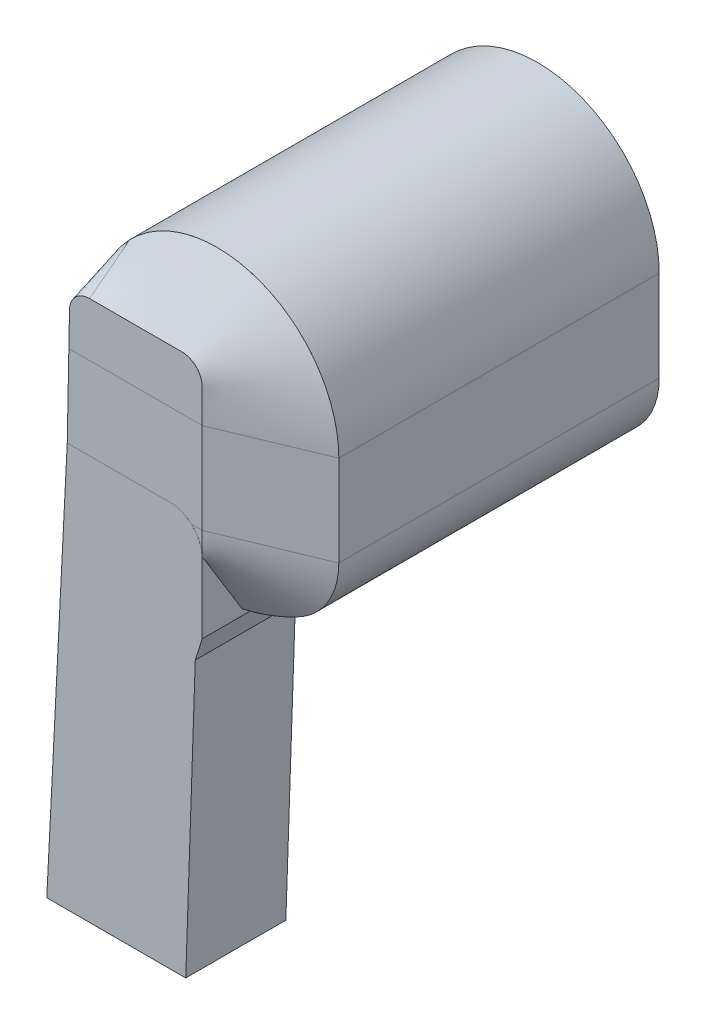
ISO-10303-21;
HEADER;
FILE_DESCRIPTION(('STEP AP214'),'2;1');
FILE_NAME('part.step','',(''),(''),'','','');
FILE_SCHEMA(('AUTOMOTIVE_DESIGN { 1 0 10303 214 1 1 1 1 }'));
ENDSEC;
DATA;
#1=APPLICATION_CONTEXT('core data for automotive mechanical design processes');
#2=APPLICATION_PROTOCOL_DEFINITION('international standard','automotive_design',2000,#1);
#3=PRODUCT_CONTEXT('',#1,'mechanical');
#4=PRODUCT('Part','Part','',(#3));
#5=PRODUCT_RELATED_PRODUCT_CATEGORY('part','',(#4));
#6=PRODUCT_DEFINITION_FORMATION('','',#4);
#7=PRODUCT_DEFINITION_CONTEXT('part definition',#1,'design');
#8=PRODUCT_DEFINITION('design','',#6,#7);
#9=PRODUCT_DEFINITION_SHAPE('','',#8);
#10=(LENGTH_UNIT() NAMED_UNIT(*) SI_UNIT(.MILLI.,.METRE.));
#11=(NAMED_UNIT(*) PLANE_ANGLE_UNIT() SI_UNIT($,.RADIAN.));
#12=(NAMED_UNIT(*) SI_UNIT($,.STERADIAN.) SOLID_ANGLE_UNIT());
#13=UNCERTAINTY_MEASURE_WITH_UNIT(LENGTH_MEASURE(1.E-05),#10,'distance_accuracy_value','');
#14=(GEOMETRIC_REPRESENTATION_CONTEXT(3) GLOBAL_UNCERTAINTY_ASSIGNED_CONTEXT((#13)) GLOBAL_UNIT_ASSIGNED_CONTEXT((#10,
#11,#12)) REPRESENTATION_CONTEXT('',''));
#15=CARTESIAN_POINT('',(0.,0.,0.));
#16=DIRECTION('',(0.,0.,1.));
#17=DIRECTION('',(1.,0.,0.));
#18=AXIS2_PLACEMENT_3D('',#15,#16,#17);
#19=CARTESIAN_POINT('',(43.6725911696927,51.3768274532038,15.));
#20=CARTESIAN_POINT('',(35.6315207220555,51.3768274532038,18.3333333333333));
#21=CARTESIAN_POINT('',(27.5904502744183,51.3768274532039,21.6666666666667));
#22=CARTESIAN_POINT('',(19.5493798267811,51.3768274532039,25.));
#23=CARTESIAN_POINT('',(43.6725911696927,49.7024317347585,15.));
#24=CARTESIAN_POINT('',(35.6315207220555,50.1737194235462,18.3333333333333));
#25=CARTESIAN_POINT('',(27.5904502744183,50.6450071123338,21.6666666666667));
#26=CARTESIAN_POINT('',(19.5493798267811,51.1162948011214,25.));
#27=CARTESIAN_POINT('',(43.2228474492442,46.3536616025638,15.));
#28=CARTESIAN_POINT('',(35.3316915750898,47.7675175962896,18.3333333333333));
#29=CARTESIAN_POINT('',(27.4405357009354,49.1813735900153,21.6666666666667));
#30=CARTESIAN_POINT('',(19.5493798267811,50.5952295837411,25.));
#31=CARTESIAN_POINT('',(41.2501625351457,41.6950228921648,15.));
#32=CARTESIAN_POINT('',(34.0165682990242,44.4007550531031,18.3333333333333));
#33=CARTESIAN_POINT('',(26.7829740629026,47.1064872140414,21.6666666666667));
#34=CARTESIAN_POINT('',(19.549379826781,49.8122193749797,25.));
#35=CARTESIAN_POINT('',(38.1333624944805,37.7340340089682,15.));
#36=CARTESIAN_POINT('',(31.9387016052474,41.4981421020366,18.3333333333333));
#37=CARTESIAN_POINT('',(25.7440407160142,45.262250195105,21.6666666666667));
#38=CARTESIAN_POINT('',(19.5493798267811,49.0263582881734,25.));
#39=CARTESIAN_POINT('',(35.4513835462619,35.7412317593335,15.));
#40=CARTESIAN_POINT('',(30.1507156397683,39.9940069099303,18.3333333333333));
#41=CARTESIAN_POINT('',(24.8500477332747,44.2467820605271,21.6666666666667));
#42=CARTESIAN_POINT('',(19.5493798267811,48.4995572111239,25.));
#43=CARTESIAN_POINT('',(32.8643604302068,34.3011779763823,15.));
#44=CARTESIAN_POINT('',(28.4260335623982,38.8758509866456,18.3333333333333));
#45=CARTESIAN_POINT('',(23.9877066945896,43.4505239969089,21.6666666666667));
#46=CARTESIAN_POINT('',(19.5493798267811,48.0251970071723,25.));
#47=CARTESIAN_POINT('',(30.5388811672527,33.1150425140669,15.));
#48=CARTESIAN_POINT('',(26.8757140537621,37.9444768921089,18.3333333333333));
#49=CARTESIAN_POINT('',(23.2125469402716,42.773911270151,21.6666666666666));
#50=CARTESIAN_POINT('',(19.549379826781,47.603345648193,25.));
#51=CARTESIAN_POINT('',(26.9572986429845,31.6005091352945,15.));
#52=CARTESIAN_POINT('',(24.4879923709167,36.7224009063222,18.3333333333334));
#53=CARTESIAN_POINT('',(22.0186860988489,41.8442926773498,21.6666666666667));
#54=CARTESIAN_POINT('',(19.5493798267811,46.9661844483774,25.));
#55=CARTESIAN_POINT('',(23.2938374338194,30.3503263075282,15.));
#56=CARTESIAN_POINT('',(22.04568489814,35.6755735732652,18.3333333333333));
#57=CARTESIAN_POINT('',(20.7975323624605,41.0008208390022,21.6666666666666));
#58=CARTESIAN_POINT('',(19.549379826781,46.3260681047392,25.));
#59=CARTESIAN_POINT('',(20.8042417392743,29.6936014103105,15.));
#60=CARTESIAN_POINT('',(20.3859544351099,35.0951847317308,18.3333333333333));
#61=CARTESIAN_POINT('',(19.9676671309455,40.4967680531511,21.6666666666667));
#62=CARTESIAN_POINT('',(19.5493798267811,45.8983513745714,25.));
#63=CARTESIAN_POINT('',(19.549379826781,29.4097281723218,15.));
#64=CARTESIAN_POINT('',(19.549379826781,34.8346537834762,18.3333333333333));
#65=CARTESIAN_POINT('',(19.549379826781,40.2595793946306,21.6666666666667));
#66=CARTESIAN_POINT('',(19.5493798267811,45.684505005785,25.));
#67=B_SPLINE_SURFACE_WITH_KNOTS('',3,3,((#19,#20,#21,#22),(#23,#24,#25,#26),(#27,#28,#29,#30),
(#31,#32,#33,#34),(#35,#36,#37,#38),(#39,#40,#41,#42),(#43,#44,#45,#46),(#47,#48,#49,#50),(#51,
#52,#53,#54),(#55,#56,#57,#58),(#59,#60,#61,#62),(#63,#64,#65,#66)),.UNSPECIFIED.,.F.,.F.,.F.,
(4,1,1,1,2,1,1,1,4),(4,4),(0.,0.139338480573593,0.278676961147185,0.418015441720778,
0.557353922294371,0.668015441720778,0.778676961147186,0.889338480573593,1.),(0.,1.),.UNSPECIFIED.);
#68=CARTESIAN_POINT('',(43.6725911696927,51.3768274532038,15.));
#69=CARTESIAN_POINT('',(43.6725911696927,49.7024317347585,15.));
#70=CARTESIAN_POINT('',(43.2228474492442,46.3536616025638,15.));
#71=CARTESIAN_POINT('',(41.2501625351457,41.6950228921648,15.));
#72=CARTESIAN_POINT('',(38.1333624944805,37.7340340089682,15.));
#73=CARTESIAN_POINT('',(35.4513835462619,35.7412317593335,15.));
#74=CARTESIAN_POINT('',(32.8643604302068,34.3011779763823,15.));
#75=CARTESIAN_POINT('',(30.5388811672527,33.1150425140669,15.));
#76=CARTESIAN_POINT('',(26.9572986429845,31.6005091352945,15.));
#77=CARTESIAN_POINT('',(23.2938374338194,30.3503263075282,15.));
#78=CARTESIAN_POINT('',(20.8042417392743,29.6936014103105,15.));
#79=CARTESIAN_POINT('',(19.549379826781,29.4097281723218,15.));
#80=B_SPLINE_CURVE_WITH_KNOTS('',3,(#68,#69,#70,#71,#72,#73,#74,#75,#76,#77,#78,#79),
.UNSPECIFIED.,.F.,.F.,(4,1,1,1,2,1,1,1,4),(0.,0.139338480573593,0.278676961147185,
0.418015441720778,0.557353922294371,0.668015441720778,0.778676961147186,0.889338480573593,1.),.UNSPECIFIED.);
#81=CARTESIAN_POINT('',(43.6725911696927,51.3768274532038,15.));
#82=VERTEX_POINT('',#81);
#83=CARTESIAN_POINT('',(19.549379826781,29.4097281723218,15.));
#84=VERTEX_POINT('',#83);
#85=EDGE_CURVE('E14',#82,#84,#80,.T.);
#86=DIRECTION('',(0.,0.852014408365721,0.523518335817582));
#87=VECTOR('',#86,1.);
#88=CARTESIAN_POINT('',(19.549379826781,37.5471165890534,20.));
#89=LINE('',#88,#87);
#90=CARTESIAN_POINT('',(19.5493798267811,45.684505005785,25.));
#91=VERTEX_POINT('',#90);
#92=EDGE_CURVE('E137',#84,#91,#89,.T.);
#93=DIRECTION('',(0.,1.,0.));
#94=VECTOR('',#93,1.);
#95=CARTESIAN_POINT('',(19.5493798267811,48.5611648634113,25.));
#96=LINE('',#95,#94);
#97=CARTESIAN_POINT('',(19.5493798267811,51.3768274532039,25.));
#98=VERTEX_POINT('',#97);
#99=EDGE_CURVE('E145',#91,#98,#96,.T.);
#100=DIRECTION('',(0.923773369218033,0.,-0.382939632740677));
#101=VECTOR('',#100,1.);
#102=CARTESIAN_POINT('',(31.6109854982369,51.3768274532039,20.));
#103=LINE('',#102,#101);
#104=EDGE_CURVE('E131',#98,#82,#103,.T.);
#105=ORIENTED_EDGE('',*,*,#85,.T.);
#106=ORIENTED_EDGE('',*,*,#92,.T.);
#107=ORIENTED_EDGE('',*,*,#99,.T.);
#108=ORIENTED_EDGE('',*,*,#104,.T.);
#109=EDGE_LOOP('',(#105,#106,#107,#108));
#110=FACE_BOUND('',#109,.T.);
#111=ADVANCED_FACE('F128',(#110),#67,.T.);
#112=OPEN_SHELL('',(#111));
#113=SHELL_BASED_SURFACE_MODEL('B2',(#112));
#114=CARTESIAN_POINT('',(43.6725911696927,74.0471432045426,15.));
#115=DIRECTION('',(-0.382939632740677,0.,-0.923773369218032));
#116=DIRECTION('',(0.,-1.,0.));
#117=AXIS2_PLACEMENT_3D('',#114,#115,#116);
#118=PLANE('',#117);
#119=DIRECTION('',(0.,-1.,0.));
#120=VECTOR('',#119,1.);
#121=CARTESIAN_POINT('',(43.6725911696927,62.7119853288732,15.));
#122=LINE('',#121,#120);
#123=CARTESIAN_POINT('',(43.6725911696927,74.0471432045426,15.));
#124=VERTEX_POINT('',#123);
#125=CARTESIAN_POINT('',(43.6725911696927,51.3768274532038,15.));
#126=VERTEX_POINT('',#125);
#127=EDGE_CURVE('E126',#124,#126,#122,.T.);
#128=ORIENTED_EDGE('',*,*,#127,.T.);
#129=DIRECTION('',(-0.923773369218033,0.,0.382939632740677));
#130=VECTOR('',#129,1.);
#131=CARTESIAN_POINT('',(31.6109854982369,51.3768274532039,20.));
#132=LINE('',#131,#130);
#133=CARTESIAN_POINT('',(19.5493798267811,51.3768274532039,25.));
#134=VERTEX_POINT('',#133);
#135=EDGE_CURVE('E201',#126,#134,#132,.T.);
#136=ORIENTED_EDGE('',*,*,#135,.T.);
#137=DIRECTION('',(0.,1.,0.));
#138=VECTOR('',#137,1.);
#139=CARTESIAN_POINT('',(19.5493798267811,62.7119853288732,25.));
#140=LINE('',#139,#138);
#141=CARTESIAN_POINT('',(19.549379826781,74.0471432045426,25.));
#142=VERTEX_POINT('',#141);
#143=EDGE_CURVE('E209',#134,#142,#140,.T.);
#144=ORIENTED_EDGE('',*,*,#143,.T.);
#145=DIRECTION('',(0.923773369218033,0.,-0.382939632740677));
#146=VECTOR('',#145,1.);
#147=CARTESIAN_POINT('',(31.6109854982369,74.0471432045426,20.));
#148=LINE('',#147,#146);
#149=EDGE_CURVE('E195',#142,#124,#148,.T.);
#150=ORIENTED_EDGE('',*,*,#149,.T.);
#151=EDGE_LOOP('',(#128,#136,#144,#150));
#152=FACE_BOUND('',#151,.T.);
#153=ADVANCED_FACE('F194',(#152),#118,.T.);
#154=OPEN_SHELL('',(#153));
#155=SHELL_BASED_SURFACE_MODEL('B8',(#154));
#156=CARTESIAN_POINT('',(-8.57242241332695,87.4439156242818,25.));
#157=CARTESIAN_POINT('',(-8.57242241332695,90.0087126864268,21.6666666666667));
#158=CARTESIAN_POINT('',(-8.57242241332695,92.5735097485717,18.3333333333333));
#159=CARTESIAN_POINT('',(-8.57242241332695,95.1383068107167,15.));
#160=CARTESIAN_POINT('',(-6.48880803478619,87.4439156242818,25.));
#161=CARTESIAN_POINT('',(-6.68486066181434,90.5254944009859,21.6666666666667));
#162=CARTESIAN_POINT('',(-6.88091328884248,93.60707317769,18.3333333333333));
#163=CARTESIAN_POINT('',(-7.07696591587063,96.6886519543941,15.));
#164=CARTESIAN_POINT('',(-2.2668384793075,87.4439156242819,25.));
#165=CARTESIAN_POINT('',(-2.76378097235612,91.453475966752,21.6666666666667));
#166=CARTESIAN_POINT('',(-3.26072346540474,95.463036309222,18.3333333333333));
#167=CARTESIAN_POINT('',(-3.75766595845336,99.4725966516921,15.));
#168=CARTESIAN_POINT('',(2.84398700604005,87.4439156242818,25.));
#169=CARTESIAN_POINT('',(2.28637209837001,92.3185443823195,21.6666666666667));
#170=CARTESIAN_POINT('',(1.72875719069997,97.1931731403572,18.3333333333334));
#171=CARTESIAN_POINT('',(1.17114228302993,102.067801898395,15.0000000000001));
#172=CARTESIAN_POINT('',(6.69856644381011,87.4439156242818,25.));
#173=CARTESIAN_POINT('',(6.33030602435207,92.7982519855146,21.6666666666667));
#174=CARTESIAN_POINT('',(5.96204560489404,98.1525883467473,18.3333333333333));
#175=CARTESIAN_POINT('',(5.59378518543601,103.50692470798,14.9999999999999));
#176=CARTESIAN_POINT('',(9.46134793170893,87.4439156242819,25.));
#177=CARTESIAN_POINT('',(9.36252088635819,93.0366582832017,21.6666666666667));
#178=CARTESIAN_POINT('',(9.26369384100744,98.6294009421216,18.3333333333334));
#179=CARTESIAN_POINT('',(9.16486679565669,104.222143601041,15.0000000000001));
#180=CARTESIAN_POINT('',(12.0848637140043,87.4439156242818,25.));
#181=CARTESIAN_POINT('',(12.3942799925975,93.1334724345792,21.6666666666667));
#182=CARTESIAN_POINT('',(12.7036962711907,98.8230292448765,18.3333333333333));
#183=CARTESIAN_POINT('',(13.0131125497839,104.512586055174,15.));
#184=CARTESIAN_POINT('',(13.7427689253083,87.4439156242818,25.));
#185=CARTESIAN_POINT('',(14.4258196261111,93.0824610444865,21.6666666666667));
#186=CARTESIAN_POINT('',(15.108870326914,98.7210064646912,18.3333333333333));
#187=CARTESIAN_POINT('',(15.7919210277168,104.359551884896,15.));
#188=CARTESIAN_POINT('',(14.79140320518,87.4439156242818,25.));
#189=CARTESIAN_POINT('',(15.756308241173,92.9995335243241,21.6666666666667));
#190=CARTESIAN_POINT('',(16.7212132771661,98.5551514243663,18.3333333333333));
#191=CARTESIAN_POINT('',(17.6861183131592,104.110769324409,15.));
#192=CARTESIAN_POINT('',(15.2246155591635,87.4104255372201,25.));
#193=CARTESIAN_POINT('',(16.3436757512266,92.9315901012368,21.6666666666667));
#194=CARTESIAN_POINT('',(17.4627359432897,98.4527546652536,18.3333333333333));
#195=CARTESIAN_POINT('',(18.5817961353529,103.97391922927,15.));
#196=CARTESIAN_POINT('',(15.9735573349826,87.2609714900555,25.));
#197=CARTESIAN_POINT('',(17.4689190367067,92.7064812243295,21.6666666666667));
#198=CARTESIAN_POINT('',(18.9642807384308,98.1519909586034,18.3333333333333));
#199=CARTESIAN_POINT('',(20.4596424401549,103.597500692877,15.));
#200=CARTESIAN_POINT('',(16.7586646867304,86.96258762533,25.));
#201=CARTESIAN_POINT('',(18.8295695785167,92.277351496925,21.6666666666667));
#202=CARTESIAN_POINT('',(20.900474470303,97.59211536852,18.3333333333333));
#203=CARTESIAN_POINT('',(22.9713793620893,102.906879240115,15.));
#204=CARTESIAN_POINT('',(17.544489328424,86.4808331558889,25.));
#205=CARTESIAN_POINT('',(20.4344371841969,91.5282553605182,21.6666666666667));
#206=CARTESIAN_POINT('',(23.3243850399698,96.5756775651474,18.3333333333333));
#207=CARTESIAN_POINT('',(26.2143328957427,101.623099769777,15.));
#208=CARTESIAN_POINT('',(18.2024329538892,85.894712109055,25.));
#209=CARTESIAN_POINT('',(21.9912175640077,90.5298339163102,21.6666666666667));
#210=CARTESIAN_POINT('',(25.7800021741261,95.1649557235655,18.3333333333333));
#211=CARTESIAN_POINT('',(29.5687867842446,99.8000775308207,15.));
#212=CARTESIAN_POINT('',(18.7440887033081,85.2112441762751,25.));
#213=CARTESIAN_POINT('',(23.4321558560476,89.2892435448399,21.6666666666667));
#214=CARTESIAN_POINT('',(28.120223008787,93.3672429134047,18.3333333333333));
#215=CARTESIAN_POINT('',(32.8082901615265,97.4452422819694,15.));
#216=CARTESIAN_POINT('',(19.1688224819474,84.4286239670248,25.));
#217=CARTESIAN_POINT('',(24.6687893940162,87.857623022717,21.6666666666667));
#218=CARTESIAN_POINT('',(30.1687563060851,91.2866220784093,18.3333333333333));
#219=CARTESIAN_POINT('',(35.668723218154,94.7156211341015,15.));
#220=CARTESIAN_POINT('',(19.461997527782,83.5310137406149,25.));
#221=CARTESIAN_POINT('',(25.6396946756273,86.3031347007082,21.6666666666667));
#222=CARTESIAN_POINT('',(31.8173918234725,89.0752556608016,18.3333333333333));
#223=CARTESIAN_POINT('',(37.9950889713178,91.8473766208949,15.));
#224=CARTESIAN_POINT('',(19.5493798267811,82.8348282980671,25.));
#225=CARTESIAN_POINT('',(26.0956409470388,85.2125034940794,21.6666666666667));
#226=CARTESIAN_POINT('',(32.6419020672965,87.5901786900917,18.3333333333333));
#227=CARTESIAN_POINT('',(39.1881631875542,89.9678538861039,15.));
#228=CARTESIAN_POINT('',(19.549379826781,81.8715114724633,25.));
#229=CARTESIAN_POINT('',(26.5226639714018,83.8185798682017,21.6666666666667));
#230=CARTESIAN_POINT('',(33.4959481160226,85.7656482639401,18.3333333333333));
#231=CARTESIAN_POINT('',(40.4692322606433,87.7127166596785,15.));
#232=CARTESIAN_POINT('',(19.549379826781,80.6569535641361,25.));
#233=CARTESIAN_POINT('',(26.9254692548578,82.1458817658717,21.6666666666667));
#234=CARTESIAN_POINT('',(34.3015586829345,83.6348099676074,18.3333333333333));
#235=CARTESIAN_POINT('',(41.6776481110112,85.123738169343,15.));
#236=CARTESIAN_POINT('',(19.5493798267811,78.6091198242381,25.));
#237=CARTESIAN_POINT('',(27.3190596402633,79.5304824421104,21.6666666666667));
#238=CARTESIAN_POINT('',(35.0887394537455,80.4518450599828,18.3333333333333));
#239=CARTESIAN_POINT('',(42.8584192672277,81.3732076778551,15.));
#240=CARTESIAN_POINT('',(19.549379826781,76.3633877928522,25.));
#241=CARTESIAN_POINT('',(27.54197137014,76.8071934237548,21.6666666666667));
#242=CARTESIAN_POINT('',(35.534562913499,77.2509990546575,18.3333333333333));
#243=CARTESIAN_POINT('',(43.527154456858,77.6948046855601,15.));
#244=CARTESIAN_POINT('',(19.549379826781,74.8105376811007,25.));
#245=CARTESIAN_POINT('',(27.5904502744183,74.9613582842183,21.6666666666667));
#246=CARTESIAN_POINT('',(35.6315207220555,75.112178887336,18.3333333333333));
#247=CARTESIAN_POINT('',(43.6725911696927,75.2629994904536,15.));
#248=CARTESIAN_POINT('',(19.549379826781,74.0471432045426,25.));
#249=CARTESIAN_POINT('',(27.5904502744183,74.0471432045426,21.6666666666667));
#250=CARTESIAN_POINT('',(35.6315207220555,74.0471432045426,18.3333333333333));
#251=CARTESIAN_POINT('',(43.6725911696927,74.0471432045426,15.));
#252=B_SPLINE_SURFACE_WITH_KNOTS('',3,3,((#156,#157,#158,#159),(#160,#161,#162,#163),(#164,#165,
#166,#167),(#168,#169,#170,#171),(#172,#173,#174,#175),(#176,#177,#178,#179),(#180,#181,#182,
#183),(#184,#185,#186,#187),(#188,#189,#190,#191),(#192,#193,#194,#195),(#196,#197,#198,#199),
(#200,#201,#202,#203),(#204,#205,#206,#207),(#208,#209,#210,#211),(#212,#213,#214,#215),(#216,
#217,#218,#219),(#220,#221,#222,#223),(#224,#225,#226,#227),(#228,#229,#230,#231),(#232,#233,
#234,#235),(#236,#237,#238,#239),(#240,#241,#242,#243),(#244,#245,#246,#247),(#248,#249,#250,
#251)),.UNSPECIFIED.,.F.,.F.,.F.,(4,1,1,1,1,1,2,1,1,1,1,1,1,1,1,2,1,1,1,4),(4,4),(0.,
0.122581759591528,0.245163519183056,0.306454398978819,0.367745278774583,0.429036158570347,
0.490327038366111,0.50871735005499,0.527107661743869,0.563888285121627,0.600668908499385,
0.637449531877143,0.674230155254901,0.711010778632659,0.747791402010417,0.784572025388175,
0.838429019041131,0.892286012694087,0.946143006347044,1.),(0.,1.),.UNSPECIFIED.);
#253=CARTESIAN_POINT('',(-8.57242241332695,87.4439156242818,25.));
#254=CARTESIAN_POINT('',(-6.48880803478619,87.4439156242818,25.));
#255=CARTESIAN_POINT('',(-2.2668384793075,87.4439156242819,25.));
#256=CARTESIAN_POINT('',(2.84398700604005,87.4439156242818,25.));
#257=CARTESIAN_POINT('',(6.69856644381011,87.4439156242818,25.));
#258=CARTESIAN_POINT('',(9.46134793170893,87.4439156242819,25.));
#259=CARTESIAN_POINT('',(12.0848637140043,87.4439156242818,25.));
#260=CARTESIAN_POINT('',(13.7427689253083,87.4439156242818,25.));
#261=CARTESIAN_POINT('',(14.79140320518,87.4439156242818,25.));
#262=CARTESIAN_POINT('',(15.2246155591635,87.4104255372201,25.));
#263=CARTESIAN_POINT('',(15.9735573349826,87.2609714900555,25.));
#264=CARTESIAN_POINT('',(16.7586646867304,86.96258762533,25.));
#265=CARTESIAN_POINT('',(17.544489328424,86.4808331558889,25.));
#266=CARTESIAN_POINT('',(18.2024329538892,85.894712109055,25.));
#267=CARTESIAN_POINT('',(18.7440887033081,85.2112441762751,25.));
#268=CARTESIAN_POINT('',(19.1688224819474,84.4286239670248,25.));
#269=CARTESIAN_POINT('',(19.461997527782,83.5310137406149,25.));
#270=CARTESIAN_POINT('',(19.5493798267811,82.8348282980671,25.));
#271=CARTESIAN_POINT('',(19.549379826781,81.8715114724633,25.));
#272=CARTESIAN_POINT('',(19.549379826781,80.6569535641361,25.));
#273=CARTESIAN_POINT('',(19.5493798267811,78.6091198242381,25.));
#274=CARTESIAN_POINT('',(19.549379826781,76.3633877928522,25.));
#275=CARTESIAN_POINT('',(19.549379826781,74.8105376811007,25.));
#276=CARTESIAN_POINT('',(19.549379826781,74.0471432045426,25.));
#277=B_SPLINE_CURVE_WITH_KNOTS('',3,(#253,#254,#255,#256,#257,#258,#259,#260,#261,#262,#263,
#264,#265,#266,#267,#268,#269,#270,#271,#272,#273,#274,#275,#276),.UNSPECIFIED.,.F.,.F.,(4,1,1,
1,1,1,2,1,1,1,1,1,1,1,1,2,1,1,1,4),(0.,0.122581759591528,0.245163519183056,0.306454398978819,
0.367745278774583,0.429036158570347,0.490327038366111,0.50871735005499,0.527107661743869,
0.563888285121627,0.600668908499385,0.637449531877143,0.674230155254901,0.711010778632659,
0.747791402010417,0.784572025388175,0.838429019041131,0.892286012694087,0.946143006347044,1.),.UNSPECIFIED.);
#278=CARTESIAN_POINT('',(-8.57242241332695,87.4439156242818,25.));
#279=VERTEX_POINT('',#278);
#280=CARTESIAN_POINT('',(19.549379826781,74.0471432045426,25.));
#281=VERTEX_POINT('',#280);
#282=EDGE_CURVE('E192',#279,#281,#277,.T.);
#283=DIRECTION('',(0.923773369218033,0.,-0.382939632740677));
#284=VECTOR('',#283,1.);
#285=CARTESIAN_POINT('',(31.6109854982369,74.0471432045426,20.));
#286=LINE('',#285,#284);
#287=CARTESIAN_POINT('',(43.6725911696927,74.0471432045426,15.));
#288=VERTEX_POINT('',#287);
#289=EDGE_CURVE('E257',#281,#288,#286,.T.);
#290=CARTESIAN_POINT('',(-8.57242241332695,95.1383068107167,15.));
#291=CARTESIAN_POINT('',(-7.07696591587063,96.6886519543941,15.));
#292=CARTESIAN_POINT('',(-3.75766595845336,99.4725966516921,15.));
#293=CARTESIAN_POINT('',(1.17114228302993,102.067801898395,15.0000000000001));
#294=CARTESIAN_POINT('',(5.59378518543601,103.50692470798,14.9999999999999));
#295=CARTESIAN_POINT('',(9.16486679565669,104.222143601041,15.0000000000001));
#296=CARTESIAN_POINT('',(13.0131125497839,104.512586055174,15.));
#297=CARTESIAN_POINT('',(15.7919210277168,104.359551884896,15.));
#298=CARTESIAN_POINT('',(17.6861183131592,104.110769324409,15.));
#299=CARTESIAN_POINT('',(18.5817961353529,103.97391922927,15.));
#300=CARTESIAN_POINT('',(20.4596424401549,103.597500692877,15.));
#301=CARTESIAN_POINT('',(22.9713793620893,102.906879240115,15.));
#302=CARTESIAN_POINT('',(26.2143328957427,101.623099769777,15.));
#303=CARTESIAN_POINT('',(29.5687867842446,99.8000775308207,15.));
#304=CARTESIAN_POINT('',(32.8082901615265,97.4452422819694,15.));
#305=CARTESIAN_POINT('',(35.668723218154,94.7156211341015,15.));
#306=CARTESIAN_POINT('',(37.9950889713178,91.8473766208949,15.));
#307=CARTESIAN_POINT('',(39.1881631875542,89.9678538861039,15.));
#308=CARTESIAN_POINT('',(40.4692322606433,87.7127166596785,15.));
#309=CARTESIAN_POINT('',(41.6776481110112,85.123738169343,15.));
#310=CARTESIAN_POINT('',(42.8584192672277,81.3732076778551,15.));
#311=CARTESIAN_POINT('',(43.527154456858,77.6948046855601,15.));
#312=CARTESIAN_POINT('',(43.6725911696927,75.2629994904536,15.));
#313=CARTESIAN_POINT('',(43.6725911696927,74.0471432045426,15.));
#314=B_SPLINE_CURVE_WITH_KNOTS('',3,(#290,#291,#292,#293,#294,#295,#296,#297,#298,#299,#300,
#301,#302,#303,#304,#305,#306,#307,#308,#309,#310,#311,#312,#313),.UNSPECIFIED.,.F.,.F.,(4,1,1,
1,1,1,2,1,1,1,1,1,1,1,1,2,1,1,1,4),(0.,0.122581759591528,0.245163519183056,0.306454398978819,
0.367745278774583,0.429036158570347,0.490327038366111,0.50871735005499,0.527107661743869,
0.563888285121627,0.600668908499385,0.637449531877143,0.674230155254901,0.711010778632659,
0.747791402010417,0.784572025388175,0.838429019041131,0.892286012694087,0.946143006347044,1.),.UNSPECIFIED.);
#315=CARTESIAN_POINT('',(-8.57242241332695,95.1383068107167,15.));
#316=VERTEX_POINT('',#315);
#317=EDGE_CURVE('E265',#288,#316,#314,.F.);
#318=DIRECTION('',(0.,-0.609814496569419,0.792544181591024));
#319=VECTOR('',#318,1.);
#320=CARTESIAN_POINT('',(-8.57242241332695,91.2911112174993,20.));
#321=LINE('',#320,#319);
#322=EDGE_CURVE('E251',#316,#279,#321,.T.);
#323=ORIENTED_EDGE('',*,*,#282,.T.);
#324=ORIENTED_EDGE('',*,*,#289,.T.);
#325=ORIENTED_EDGE('',*,*,#317,.T.);
#326=ORIENTED_EDGE('',*,*,#322,.T.);
#327=EDGE_LOOP('',(#323,#324,#325,#326));
#328=FACE_BOUND('',#327,.T.);
#329=ADVANCED_FACE('F248',(#328),#252,.T.);
#330=OPEN_SHELL('',(#329));
#331=SHELL_BASED_SURFACE_MODEL('B120',(#330));
#332=CARTESIAN_POINT('',(-8.57242241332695,87.4439156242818,25.));
#333=CARTESIAN_POINT('',(-8.57242241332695,95.1383068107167,15.));
#334=CARTESIAN_POINT('',(-9.07784668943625,87.4439156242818,25.));
#335=CARTESIAN_POINT('',(-8.99071470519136,94.7046616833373,15.));
#336=CARTESIAN_POINT('',(-10.0886381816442,87.2895648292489,25.));
#337=CARTESIAN_POINT('',(-9.80149282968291,93.8124787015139,15.));
#338=CARTESIAN_POINT('',(-11.4662236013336,86.6157168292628,25.));
#339=CARTESIAN_POINT('',(-10.9361229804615,92.4040088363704,15.));
#340=CARTESIAN_POINT('',(-12.5795145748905,85.5618185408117,25.));
#341=CARTESIAN_POINT('',(-11.9853331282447,90.9300359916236,15.));
#342=CARTESIAN_POINT('',(-13.0777951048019,84.6702022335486,25.));
#343=CARTESIAN_POINT('',(-12.6254255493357,89.9069739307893,15.));
#344=CARTESIAN_POINT('',(-13.3045183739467,84.0648270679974,25.));
#345=CARTESIAN_POINT('',(-13.0156024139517,89.2399454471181,15.));
#346=CARTESIAN_POINT('',(-13.3921491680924,83.796531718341,25.));
#347=CARTESIAN_POINT('',(-13.1689302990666,88.9350507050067,15.));
#348=CARTESIAN_POINT('',(-13.4888956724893,83.3860271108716,25.));
#349=CARTESIAN_POINT('',(-13.3391865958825,88.450183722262,15.));
#350=CARTESIAN_POINT('',(-13.5509308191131,82.9677529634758,25.));
#351=CARTESIAN_POINT('',(-13.4457142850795,87.9488803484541,15.));
#352=CARTESIAN_POINT('',(-13.5687161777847,82.6838472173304,25.));
#353=CARTESIAN_POINT('',(-13.4733818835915,87.611523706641,15.));
#354=CARTESIAN_POINT('',(-13.6183938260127,80.1160893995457,25.));
#355=CARTESIAN_POINT('',(-13.5315203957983,84.6064374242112,15.));
#356=CARTESIAN_POINT('',(-13.7122364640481,75.2655142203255,25.));
#357=CARTESIAN_POINT('',(-13.6412781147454,78.9332372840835,15.));
#358=CARTESIAN_POINT('',(-13.8530654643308,67.9862894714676,25.));
#359=CARTESIAN_POINT('',(-13.8058383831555,70.4273814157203,15.));
#360=CARTESIAN_POINT('',(-13.9939378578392,60.7048217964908,25.));
#361=CARTESIAN_POINT('',(-13.9703478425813,61.9241517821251,15.));
#362=CARTESIAN_POINT('',(-14.0878672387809,55.8497630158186,25.));
#363=CARTESIAN_POINT('',(-14.0800038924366,56.2562067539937,15.));
#364=CARTESIAN_POINT('',(-14.1348319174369,53.4222342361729,25.));
#365=CARTESIAN_POINT('',(-14.1348319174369,53.4222342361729,15.));
#366=B_SPLINE_SURFACE_WITH_KNOTS('',3,1,((#332,#333),(#334,#335),(#336,#337),(#338,#339),(#340,
#341),(#342,#343),(#344,#345),(#346,#347),(#348,#349),(#350,#351),(#352,#353),(#354,#355),(#356,
#357),(#358,#359),(#360,#361),(#362,#363),(#364,#365)),.UNSPECIFIED.,.F.,.F.,.F.,(4,1,1,1,2,1,1,
1,2,1,1,1,4),(2,2),(0.,0.0414277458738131,0.0828554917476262,0.124283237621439,
0.165710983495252,0.177344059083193,0.188977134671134,0.200610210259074,0.212243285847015,
0.409182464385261,0.606121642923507,0.803060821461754,1.),(0.,1.),.UNSPECIFIED.);
#367=CARTESIAN_POINT('',(-8.57242241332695,87.4439156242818,25.));
#368=CARTESIAN_POINT('',(-9.07784668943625,87.4439156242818,25.));
#369=CARTESIAN_POINT('',(-10.0886381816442,87.2895648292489,25.));
#370=CARTESIAN_POINT('',(-11.4662236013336,86.6157168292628,25.));
#371=CARTESIAN_POINT('',(-12.5795145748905,85.5618185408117,25.));
#372=CARTESIAN_POINT('',(-13.0777951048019,84.6702022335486,25.));
#373=CARTESIAN_POINT('',(-13.3045183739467,84.0648270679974,25.));
#374=CARTESIAN_POINT('',(-13.3921491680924,83.796531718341,25.));
#375=CARTESIAN_POINT('',(-13.4888956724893,83.3860271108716,25.));
#376=CARTESIAN_POINT('',(-13.5509308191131,82.9677529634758,25.));
#377=CARTESIAN_POINT('',(-13.5687161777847,82.6838472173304,25.));
#378=CARTESIAN_POINT('',(-13.6183938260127,80.1160893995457,25.));
#379=CARTESIAN_POINT('',(-13.7122364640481,75.2655142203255,25.));
#380=CARTESIAN_POINT('',(-13.8530654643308,67.9862894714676,25.));
#381=CARTESIAN_POINT('',(-13.9939378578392,60.7048217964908,25.));
#382=CARTESIAN_POINT('',(-14.0878672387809,55.8497630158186,25.));
#383=CARTESIAN_POINT('',(-14.1348319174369,53.4222342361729,25.));
#384=B_SPLINE_CURVE_WITH_KNOTS('',3,(#367,#368,#369,#370,#371,#372,#373,#374,#375,#376,#377,
#378,#379,#380,#381,#382,#383),.UNSPECIFIED.,.F.,.F.,(4,1,1,1,2,1,1,1,2,1,1,1,4),(0.,
0.0414277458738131,0.0828554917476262,0.124283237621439,0.165710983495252,0.177344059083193,
0.188977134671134,0.200610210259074,0.212243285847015,0.409182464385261,0.606121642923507,
0.803060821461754,1.),.UNSPECIFIED.);
#385=CARTESIAN_POINT('',(-8.57242241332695,87.4439156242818,25.));
#386=VERTEX_POINT('',#385);
#387=CARTESIAN_POINT('',(-14.1348319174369,53.4222342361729,25.));
#388=VERTEX_POINT('',#387);
#389=EDGE_CURVE('E246',#386,#388,#384,.T.);
#390=DIRECTION('',(0.,0.,-1.));
#391=VECTOR('',#390,1.);
#392=CARTESIAN_POINT('',(-14.1348319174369,53.4222342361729,20.));
#393=LINE('',#392,#391);
#394=CARTESIAN_POINT('',(-14.1348319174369,53.4222342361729,15.));
#395=VERTEX_POINT('',#394);
#396=EDGE_CURVE('E328',#388,#395,#393,.T.);
#397=CARTESIAN_POINT('',(-8.57242241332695,95.1383068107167,15.));
#398=CARTESIAN_POINT('',(-8.99071470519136,94.7046616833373,15.));
#399=CARTESIAN_POINT('',(-9.80149282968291,93.8124787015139,15.));
#400=CARTESIAN_POINT('',(-10.9361229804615,92.4040088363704,15.));
#401=CARTESIAN_POINT('',(-11.9853331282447,90.9300359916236,15.));
#402=CARTESIAN_POINT('',(-12.6254255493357,89.9069739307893,15.));
#403=CARTESIAN_POINT('',(-13.0156024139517,89.2399454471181,15.));
#404=CARTESIAN_POINT('',(-13.1689302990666,88.9350507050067,15.));
#405=CARTESIAN_POINT('',(-13.3391865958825,88.450183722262,15.));
#406=CARTESIAN_POINT('',(-13.4457142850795,87.9488803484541,15.));
#407=CARTESIAN_POINT('',(-13.4733818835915,87.611523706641,15.));
#408=CARTESIAN_POINT('',(-13.5315203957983,84.6064374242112,15.));
#409=CARTESIAN_POINT('',(-13.6412781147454,78.9332372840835,15.));
#410=CARTESIAN_POINT('',(-13.8058383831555,70.4273814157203,15.));
#411=CARTESIAN_POINT('',(-13.9703478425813,61.9241517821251,15.));
#412=CARTESIAN_POINT('',(-14.0800038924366,56.2562067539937,15.));
#413=CARTESIAN_POINT('',(-14.1348319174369,53.4222342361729,15.));
#414=B_SPLINE_CURVE_WITH_KNOTS('',3,(#397,#398,#399,#400,#401,#402,#403,#404,#405,#406,#407,
#408,#409,#410,#411,#412,#413),.UNSPECIFIED.,.F.,.F.,(4,1,1,1,2,1,1,1,2,1,1,1,4),(0.,
0.0414277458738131,0.0828554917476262,0.124283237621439,0.165710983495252,0.177344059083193,
0.188977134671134,0.200610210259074,0.212243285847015,0.409182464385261,0.606121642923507,
0.803060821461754,1.),.UNSPECIFIED.);
#415=CARTESIAN_POINT('',(-8.57242241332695,95.1383068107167,15.));
#416=VERTEX_POINT('',#415);
#417=EDGE_CURVE('E336',#395,#416,#414,.F.);
#418=DIRECTION('',(0.,-0.60981449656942,0.792544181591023));
#419=VECTOR('',#418,1.);
#420=CARTESIAN_POINT('',(-8.57242241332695,91.2911112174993,20.));
#421=LINE('',#420,#419);
#422=EDGE_CURVE('E322',#416,#386,#421,.T.);
#423=ORIENTED_EDGE('',*,*,#389,.T.);
#424=ORIENTED_EDGE('',*,*,#396,.T.);
#425=ORIENTED_EDGE('',*,*,#417,.T.);
#426=ORIENTED_EDGE('',*,*,#422,.T.);
#427=EDGE_LOOP('',(#423,#424,#425,#426));
#428=FACE_BOUND('',#427,.T.);
#429=ADVANCED_FACE('F319',(#428),#366,.T.);
#430=OPEN_SHELL('',(#429));
#431=SHELL_BASED_SURFACE_MODEL('B186',(#430));
#432=CARTESIAN_POINT('',(11.3313204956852,45.2931515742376,25.));
#433=DIRECTION('',(0.,0.,1.));
#434=DIRECTION('',(1.,0.,0.));
#435=AXIS2_PLACEMENT_3D('',#432,#433,#434);
#436=PLANE('',#435);
#437=DIRECTION('',(0.,1.,0.));
#438=VECTOR('',#437,1.);
#439=CARTESIAN_POINT('',(19.549379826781,82.4439156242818,25.));
#440=LINE('',#439,#438);
#441=CARTESIAN_POINT('',(19.5493798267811,51.3768274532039,25.));
#442=VERTEX_POINT('',#441);
#443=CARTESIAN_POINT('',(19.549379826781,74.0471432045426,25.));
#444=VERTEX_POINT('',#443);
#445=EDGE_CURVE('E409',#442,#444,#440,.T.);
#446=ORIENTED_EDGE('',*,*,#445,.T.);
#447=DIRECTION('',(-1.,0.,0.));
#448=VECTOR('',#447,1.);
#449=CARTESIAN_POINT('',(11.3313204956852,74.0471432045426,25.));
#450=LINE('',#449,#448);
#451=CARTESIAN_POINT('',(-13.7358079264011,74.0471432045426,25.));
#452=VERTEX_POINT('',#451);
#453=EDGE_CURVE('E317',#444,#452,#450,.T.);
#454=ORIENTED_EDGE('',*,*,#453,.T.);
#455=DIRECTION('',(-0.0193430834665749,-0.999812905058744,0.));
#456=VECTOR('',#455,1.);
#457=CARTESIAN_POINT('',(-14.1348319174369,53.4222342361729,25.));
#458=LINE('',#457,#456);
#459=CARTESIAN_POINT('',(-14.1348319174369,53.4222342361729,25.));
#460=VERTEX_POINT('',#459);
#461=EDGE_CURVE('E466',#452,#460,#458,.T.);
#462=ORIENTED_EDGE('',*,*,#461,.T.);
#463=DIRECTION('',(1.,0.,0.));
#464=VECTOR('',#463,1.);
#465=CARTESIAN_POINT('',(12.5992604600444,53.4222342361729,25.));
#466=LINE('',#465,#464);
#467=CARTESIAN_POINT('',(12.5992604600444,53.4222342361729,25.));
#468=VERTEX_POINT('',#467);
#469=EDGE_CURVE('E465',#460,#468,#466,.T.);
#470=ORIENTED_EDGE('',*,*,#469,.T.);
#471=CARTESIAN_POINT('',(11.3313204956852,45.2931515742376,25.));
#472=DIRECTION('',(0.,0.,-1.));
#473=DIRECTION('',(1.,0.,0.));
#474=AXIS2_PLACEMENT_3D('',#471,#472,#473);
#475=CIRCLE('',#474,8.22737240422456);
#476=CARTESIAN_POINT('',(16.870142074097,51.3768274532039,25.));
#477=VERTEX_POINT('',#476);
#478=EDGE_CURVE('E443',#468,#477,#475,.T.);
#479=ORIENTED_EDGE('',*,*,#478,.T.);
#480=DIRECTION('',(1.,0.,0.));
#481=VECTOR('',#480,1.);
#482=CARTESIAN_POINT('',(11.3313204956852,51.3768274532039,25.));
#483=LINE('',#482,#481);
#484=EDGE_CURVE('E391',#477,#442,#483,.T.);
#485=ORIENTED_EDGE('',*,*,#484,.T.);
#486=EDGE_LOOP('',(#446,#454,#462,#470,#479,#485));
#487=FACE_BOUND('',#486,.T.);
#488=ADVANCED_FACE('F389',(#487),#436,.T.);
#489=ORIENTED_EDGE('',*,*,#453,.F.);
#490=CARTESIAN_POINT('',(19.5493798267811,82.4439156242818,25.));
#491=VERTEX_POINT('',#490);
#492=EDGE_CURVE('E448',#444,#491,#440,.T.);
#493=ORIENTED_EDGE('',*,*,#492,.T.);
#494=CARTESIAN_POINT('',(14.549379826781,82.4439156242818,25.));
#495=DIRECTION('',(0.,0.,1.));
#496=DIRECTION('',(1.,0.,0.));
#497=AXIS2_PLACEMENT_3D('',#494,#495,#496);
#498=CIRCLE('',#497,5.00000000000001);
#499=CARTESIAN_POINT('',(14.549379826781,87.4439156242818,25.));
#500=VERTEX_POINT('',#499);
#501=EDGE_CURVE('E446',#491,#500,#498,.T.);
#502=ORIENTED_EDGE('',*,*,#501,.T.);
#503=DIRECTION('',(-1.,0.,0.));
#504=VECTOR('',#503,1.);
#505=CARTESIAN_POINT('',(-8.57242241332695,87.4439156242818,25.));
#506=LINE('',#505,#504);
#507=CARTESIAN_POINT('',(-8.57242241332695,87.4439156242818,25.));
#508=VERTEX_POINT('',#507);
#509=EDGE_CURVE('E453',#500,#508,#506,.T.);
#510=ORIENTED_EDGE('',*,*,#509,.T.);
#511=CARTESIAN_POINT('',(-8.57242241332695,82.4439156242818,25.));
#512=DIRECTION('',(0.,0.,1.));
#513=DIRECTION('',(1.,0.,0.));
#514=AXIS2_PLACEMENT_3D('',#511,#512,#513);
#515=CIRCLE('',#514,5.00000000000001);
#516=CARTESIAN_POINT('',(-13.5714869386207,82.5406310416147,25.));
#517=VERTEX_POINT('',#516);
#518=EDGE_CURVE('E475',#508,#517,#515,.T.);
#519=ORIENTED_EDGE('',*,*,#518,.T.);
#520=EDGE_CURVE('E402',#517,#452,#458,.T.);
#521=ORIENTED_EDGE('',*,*,#520,.T.);
#522=EDGE_LOOP('',(#489,#493,#502,#510,#519,#521));
#523=FACE_BOUND('',#522,.T.);
#524=ADVANCED_FACE('F483',(#523),#436,.T.);
#525=ORIENTED_EDGE('',*,*,#484,.F.);
#526=CARTESIAN_POINT('',(19.5493798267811,45.684505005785,25.));
#527=VERTEX_POINT('',#526);
#528=EDGE_CURVE('E439',#477,#527,#475,.T.);
#529=ORIENTED_EDGE('',*,*,#528,.T.);
#530=EDGE_CURVE('E441',#527,#442,#440,.T.);
#531=ORIENTED_EDGE('',*,*,#530,.T.);
#532=EDGE_LOOP('',(#525,#529,#531));
#533=FACE_BOUND('',#532,.T.);
#534=ADVANCED_FACE('F390',(#533),#436,.T.);
#535=OPEN_SHELL('',(#488,#524,#534));
#536=SHELL_BASED_SURFACE_MODEL('B240',(#535));
#537=CARTESIAN_POINT('',(13.2928629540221,74.0471432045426,-65.));
#538=DIRECTION('',(0.,0.,1.));
#539=DIRECTION('',(1.,0.,0.));
#540=AXIS2_PLACEMENT_3D('',#537,#538,#539);
#541=CYLINDRICAL_SURFACE('',#540,30.3797282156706);
#542=CARTESIAN_POINT('',(13.2928629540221,74.0471432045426,-65.));
#543=DIRECTION('',(0.,0.,1.));
#544=DIRECTION('',(1.,0.,0.));
#545=AXIS2_PLACEMENT_3D('',#542,#543,#544);
#546=CIRCLE('',#545,30.3797282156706);
#547=CARTESIAN_POINT('',(43.6725911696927,74.0471432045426,-65.));
#548=VERTEX_POINT('',#547);
#549=CARTESIAN_POINT('',(-8.57242241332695,95.1383068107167,-65.));
#550=VERTEX_POINT('',#549);
#551=EDGE_CURVE('E995',#548,#550,#546,.T.);
#552=ORIENTED_EDGE('',*,*,#551,.T.);
#553=DIRECTION('',(0.,0.,1.));
#554=VECTOR('',#553,1.);
#555=CARTESIAN_POINT('',(-8.57242241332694,95.1383068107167,-65.));
#556=LINE('',#555,#554);
#557=CARTESIAN_POINT('',(-8.57242241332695,95.1383068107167,15.));
#558=VERTEX_POINT('',#557);
#559=EDGE_CURVE('E387',#550,#558,#556,.T.);
#560=ORIENTED_EDGE('',*,*,#559,.T.);
#561=CARTESIAN_POINT('',(13.2928629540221,74.0471432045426,15.));
#562=DIRECTION('',(0.,0.,1.));
#563=DIRECTION('',(1.,0.,0.));
#564=AXIS2_PLACEMENT_3D('',#561,#562,#563);
#565=CIRCLE('',#564,30.3797282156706);
#566=CARTESIAN_POINT('',(43.6725911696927,74.0471432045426,15.));
#567=VERTEX_POINT('',#566);
#568=EDGE_CURVE('E845',#567,#558,#565,.T.);
#569=ORIENTED_EDGE('',*,*,#568,.F.);
#570=DIRECTION('',(0.,0.,1.));
#571=VECTOR('',#570,1.);
#572=CARTESIAN_POINT('',(43.6725911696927,74.0471432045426,-65.));
#573=LINE('',#572,#571);
#574=EDGE_CURVE('E996',#548,#567,#573,.T.);
#575=ORIENTED_EDGE('',*,*,#574,.F.);
#576=EDGE_LOOP('',(#552,#560,#569,#575));
#577=FACE_BOUND('',#576,.T.);
#578=ADVANCED_FACE('F527',(#577),#541,.T.);
#579=CARTESIAN_POINT('',(-7.24053211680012,46.8617340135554,-65.));
#580=DIRECTION('',(0.,0.,1.));
#581=DIRECTION('',(1.,0.,0.));
#582=AXIS2_PLACEMENT_3D('',#579,#580,#581);
#583=CYLINDRICAL_SURFACE('',#582,6.73666835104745);
#584=DIRECTION('',(0.,0.,1.));
#585=VECTOR('',#584,1.);
#586=CARTESIAN_POINT('',(-8.77106708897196,53.4222342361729,-65.));
#587=LINE('',#586,#585);
#588=CARTESIAN_POINT('',(-8.77106708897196,53.4222342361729,-65.));
#589=VERTEX_POINT('',#588);
#590=CARTESIAN_POINT('',(-8.77106708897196,53.4222342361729,0.));
#591=VERTEX_POINT('',#590);
#592=EDGE_CURVE('E1017',#589,#591,#587,.T.);
#593=ORIENTED_EDGE('',*,*,#592,.T.);
#594=CARTESIAN_POINT('',(-7.24053211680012,46.8617340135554,0.));
#595=DIRECTION('',(0.,0.,1.));
#596=DIRECTION('',(1.,0.,0.));
#597=AXIS2_PLACEMENT_3D('',#594,#595,#596);
#598=CIRCLE('',#597,6.73666835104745);
#599=CARTESIAN_POINT('',(-12.1966601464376,51.4245725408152,0.));
#600=VERTEX_POINT('',#599);
#601=EDGE_CURVE('E788',#591,#600,#598,.T.);
#602=ORIENTED_EDGE('',*,*,#601,.T.);
#603=DIRECTION('',(0.,0.,1.));
#604=VECTOR('',#603,1.);
#605=CARTESIAN_POINT('',(-12.1966601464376,51.4245725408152,-65.));
#606=LINE('',#605,#604);
#607=CARTESIAN_POINT('',(-12.1966601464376,51.4245725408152,-65.));
#608=VERTEX_POINT('',#607);
#609=EDGE_CURVE('E536',#608,#600,#606,.T.);
#610=ORIENTED_EDGE('',*,*,#609,.F.);
#611=CARTESIAN_POINT('',(-7.24053211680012,46.8617340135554,-65.));
#612=DIRECTION('',(0.,0.,-1.));
#613=DIRECTION('',(1.,0.,0.));
#614=AXIS2_PLACEMENT_3D('',#611,#612,#613);
#615=CIRCLE('',#614,6.73666835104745);
#616=EDGE_CURVE('E1160',#608,#589,#615,.T.);
#617=ORIENTED_EDGE('',*,*,#616,.T.);
#618=EDGE_LOOP('',(#593,#602,#610,#617));
#619=FACE_BOUND('',#618,.T.);
#620=ADVANCED_FACE('F529',(#619),#583,.F.);
#621=CARTESIAN_POINT('',(-12.1966601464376,51.4245725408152,-65.));
#622=DIRECTION('',(0.,-1.,0.));
#623=DIRECTION('',(0.,0.,-1.));
#624=AXIS2_PLACEMENT_3D('',#621,#622,#623);
#625=PLANE('',#624);
#626=ORIENTED_EDGE('',*,*,#609,.T.);
#627=DIRECTION('',(-1.,0.,0.));
#628=VECTOR('',#627,1.);
#629=CARTESIAN_POINT('',(-12.1966601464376,51.4245725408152,0.));
#630=LINE('',#629,#628);
#631=CARTESIAN_POINT('',(-13.1539462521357,51.4245725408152,0.));
#632=VERTEX_POINT('',#631);
#633=EDGE_CURVE('E785',#600,#632,#630,.T.);
#634=ORIENTED_EDGE('',*,*,#633,.T.);
#635=DIRECTION('',(0.,0.,1.));
#636=VECTOR('',#635,1.);
#637=CARTESIAN_POINT('',(-13.1539462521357,51.4245725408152,-65.));
#638=LINE('',#637,#636);
#639=CARTESIAN_POINT('',(-13.1539462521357,51.4245725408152,-65.));
#640=VERTEX_POINT('',#639);
#641=EDGE_CURVE('E1020',#640,#632,#638,.T.);
#642=ORIENTED_EDGE('',*,*,#641,.F.);
#643=DIRECTION('',(1.,0.,0.));
#644=VECTOR('',#643,1.);
#645=CARTESIAN_POINT('',(-12.1966601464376,51.4245725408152,-65.));
#646=LINE('',#645,#644);
#647=EDGE_CURVE('E1014',#640,#608,#646,.T.);
#648=ORIENTED_EDGE('',*,*,#647,.T.);
#649=EDGE_LOOP('',(#626,#634,#642,#648));
#650=FACE_BOUND('',#649,.T.);
#651=ADVANCED_FACE('F942',(#650),#625,.T.);
#652=CARTESIAN_POINT('',(-13.1539462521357,52.4245725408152,-65.));
#653=DIRECTION('',(0.,0.,1.));
#654=DIRECTION('',(1.,0.,0.));
#655=AXIS2_PLACEMENT_3D('',#652,#653,#654);
#656=CYLINDRICAL_SURFACE('',#655,1.);
#657=ORIENTED_EDGE('',*,*,#641,.T.);
#658=CARTESIAN_POINT('',(-13.1539462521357,52.4245725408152,0.));
#659=DIRECTION('',(0.,0.,1.));
#660=DIRECTION('',(1.,0.,0.));
#661=AXIS2_PLACEMENT_3D('',#658,#659,#660);
#662=CIRCLE('',#661,1.);
#663=CARTESIAN_POINT('',(-14.1537591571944,52.4439156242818,0.));
#664=VERTEX_POINT('',#663);
#665=EDGE_CURVE('E782',#632,#664,#662,.F.);
#666=ORIENTED_EDGE('',*,*,#665,.T.);
#667=DIRECTION('',(0.,0.,1.));
#668=VECTOR('',#667,1.);
#669=CARTESIAN_POINT('',(-14.1537591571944,52.4439156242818,-65.));
#670=LINE('',#669,#668);
#671=CARTESIAN_POINT('',(-14.1537591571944,52.4439156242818,-65.));
#672=VERTEX_POINT('',#671);
#673=EDGE_CURVE('E1023',#672,#664,#670,.T.);
#674=ORIENTED_EDGE('',*,*,#673,.F.);
#675=CARTESIAN_POINT('',(-13.1539462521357,52.4245725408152,-65.));
#676=DIRECTION('',(0.,0.,1.));
#677=DIRECTION('',(1.,0.,0.));
#678=AXIS2_PLACEMENT_3D('',#675,#676,#677);
#679=CIRCLE('',#678,1.);
#680=EDGE_CURVE('E1011',#672,#640,#679,.T.);
#681=ORIENTED_EDGE('',*,*,#680,.T.);
#682=EDGE_LOOP('',(#657,#666,#674,#681));
#683=FACE_BOUND('',#682,.T.);
#684=ADVANCED_FACE('F945',(#683),#656,.T.);
#685=CARTESIAN_POINT('',(-13.4766245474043,87.4439156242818,-65.));
#686=DIRECTION('',(-0.999812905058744,0.0193430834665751,0.));
#687=DIRECTION('',(-0.0193430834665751,-0.999812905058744,0.));
#688=AXIS2_PLACEMENT_3D('',#685,#686,#687);
#689=PLANE('',#688);
#690=DIRECTION('',(0.0193430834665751,0.999812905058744,0.));
#691=VECTOR('',#690,1.);
#692=CARTESIAN_POINT('',(-13.4766245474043,87.4439156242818,0.));
#693=LINE('',#692,#691);
#694=CARTESIAN_POINT('',(-14.1348319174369,53.4222342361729,0.));
#695=VERTEX_POINT('',#694);
#696=EDGE_CURVE('E774',#664,#695,#693,.T.);
#697=ORIENTED_EDGE('',*,*,#696,.T.);
#698=DIRECTION('',(0.,0.,-1.));
#699=VECTOR('',#698,1.);
#700=CARTESIAN_POINT('',(-14.1348319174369,53.4222342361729,25.));
#701=LINE('',#700,#699);
#702=CARTESIAN_POINT('',(-14.1348319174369,53.4222342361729,15.));
#703=VERTEX_POINT('',#702);
#704=EDGE_CURVE('E1065',#703,#695,#701,.T.);
#705=ORIENTED_EDGE('',*,*,#704,.F.);
#706=DIRECTION('',(-0.0193430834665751,-0.999812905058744,0.));
#707=VECTOR('',#706,1.);
#708=CARTESIAN_POINT('',(-13.4766245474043,87.4439156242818,15.));
#709=LINE('',#708,#707);
#710=CARTESIAN_POINT('',(-13.4766245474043,87.4439156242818,15.));
#711=VERTEX_POINT('',#710);
#712=EDGE_CURVE('E851',#711,#703,#709,.T.);
#713=ORIENTED_EDGE('',*,*,#712,.F.);
#714=DIRECTION('',(0.,0.,1.));
#715=VECTOR('',#714,1.);
#716=CARTESIAN_POINT('',(-13.4766245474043,87.4439156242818,-65.));
#717=LINE('',#716,#715);
#718=CARTESIAN_POINT('',(-13.4766245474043,87.4439156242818,-65.));
#719=VERTEX_POINT('',#718);
#720=EDGE_CURVE('E1026',#719,#711,#717,.T.);
#721=ORIENTED_EDGE('',*,*,#720,.F.);
#722=DIRECTION('',(-0.0193430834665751,-0.999812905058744,0.));
#723=VECTOR('',#722,1.);
#724=CARTESIAN_POINT('',(-13.4766245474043,87.4439156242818,-65.));
#725=LINE('',#724,#723);
#726=EDGE_CURVE('E1003',#719,#672,#725,.T.);
#727=ORIENTED_EDGE('',*,*,#726,.T.);
#728=ORIENTED_EDGE('',*,*,#673,.T.);
#729=EDGE_LOOP('',(#697,#705,#713,#721,#727,#728));
#730=FACE_BOUND('',#729,.T.);
#731=ADVANCED_FACE('F949',(#730),#689,.T.);
#732=CARTESIAN_POINT('',(19.549379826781,44.90179814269,-65.));
#733=DIRECTION('',(-1.,0.,0.));
#734=DIRECTION('',(0.,-1.,0.));
#735=AXIS2_PLACEMENT_3D('',#732,#733,#734);
#736=PLANE('',#735);
#737=DIRECTION('',(0.,0.,1.));
#738=VECTOR('',#737,1.);
#739=CARTESIAN_POINT('',(19.5493798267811,29.4097281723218,-65.));
#740=LINE('',#739,#738);
#741=CARTESIAN_POINT('',(19.5493798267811,29.4097281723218,-65.));
#742=VERTEX_POINT('',#741);
#743=CARTESIAN_POINT('',(19.5493798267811,29.4097281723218,0.));
#744=VERTEX_POINT('',#743);
#745=EDGE_CURVE('E1036',#742,#744,#740,.T.);
#746=ORIENTED_EDGE('',*,*,#745,.T.);
#747=DIRECTION('',(0.,1.,0.));
#748=VECTOR('',#747,1.);
#749=CARTESIAN_POINT('',(19.549379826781,44.90179814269,0.));
#750=LINE('',#749,#748);
#751=CARTESIAN_POINT('',(19.549379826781,44.90179814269,0.));
#752=VERTEX_POINT('',#751);
#753=EDGE_CURVE('E1058',#744,#752,#750,.T.);
#754=ORIENTED_EDGE('',*,*,#753,.T.);
#755=DIRECTION('',(0.,0.,1.));
#756=VECTOR('',#755,1.);
#757=CARTESIAN_POINT('',(19.549379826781,44.90179814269,-65.));
#758=LINE('',#757,#756);
#759=CARTESIAN_POINT('',(19.549379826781,44.90179814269,-65.));
#760=VERTEX_POINT('',#759);
#761=EDGE_CURVE('E1039',#760,#752,#758,.T.);
#762=ORIENTED_EDGE('',*,*,#761,.F.);
#763=DIRECTION('',(0.,-1.,0.));
#764=VECTOR('',#763,1.);
#765=CARTESIAN_POINT('',(19.549379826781,44.90179814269,-65.));
#766=LINE('',#765,#764);
#767=EDGE_CURVE('E1180',#760,#742,#766,.T.);
#768=ORIENTED_EDGE('',*,*,#767,.T.);
#769=EDGE_LOOP('',(#746,#754,#762,#768));
#770=FACE_BOUND('',#769,.T.);
#771=ADVANCED_FACE('F953',(#770),#736,.T.);
#772=CARTESIAN_POINT('',(11.3313204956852,45.2931515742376,-65.));
#773=DIRECTION('',(0.,0.,1.));
#774=DIRECTION('',(1.,0.,0.));
#775=AXIS2_PLACEMENT_3D('',#772,#773,#774);
#776=CYLINDRICAL_SURFACE('',#775,8.22737240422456);
#777=ORIENTED_EDGE('',*,*,#761,.T.);
#778=CARTESIAN_POINT('',(11.3313204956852,45.2931515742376,0.));
#779=DIRECTION('',(0.,0.,1.));
#780=DIRECTION('',(1.,0.,0.));
#781=AXIS2_PLACEMENT_3D('',#778,#779,#780);
#782=CIRCLE('',#781,8.22737240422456);
#783=CARTESIAN_POINT('',(12.5992604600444,53.4222342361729,0.));
#784=VERTEX_POINT('',#783);
#785=EDGE_CURVE('E1050',#752,#784,#782,.T.);
#786=ORIENTED_EDGE('',*,*,#785,.T.);
#787=DIRECTION('',(0.,0.,1.));
#788=VECTOR('',#787,1.);
#789=CARTESIAN_POINT('',(12.5992604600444,53.4222342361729,-65.));
#790=LINE('',#789,#788);
#791=CARTESIAN_POINT('',(12.5992604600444,53.4222342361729,-35.));
#792=VERTEX_POINT('',#791);
#793=EDGE_CURVE('E1044',#792,#784,#790,.T.);
#794=ORIENTED_EDGE('',*,*,#793,.F.);
#795=CARTESIAN_POINT('',(11.3313204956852,45.2931515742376,-35.));
#796=DIRECTION('',(0.,0.,1.));
#797=DIRECTION('',(1.,0.,0.));
#798=AXIS2_PLACEMENT_3D('',#795,#796,#797);
#799=CIRCLE('',#798,8.22737240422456);
#800=CARTESIAN_POINT('',(13.1589835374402,53.3149533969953,-35.));
#801=VERTEX_POINT('',#800);
#802=EDGE_CURVE('E872',#792,#801,#799,.F.);
#803=ORIENTED_EDGE('',*,*,#802,.T.);
#804=DIRECTION('',(0.,0.,1.));
#805=VECTOR('',#804,1.);
#806=CARTESIAN_POINT('',(13.1589835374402,53.3149533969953,-65.));
#807=LINE('',#806,#805);
#808=CARTESIAN_POINT('',(13.1589835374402,53.3149533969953,-62.));
#809=VERTEX_POINT('',#808);
#810=EDGE_CURVE('E869',#801,#809,#807,.F.);
#811=ORIENTED_EDGE('',*,*,#810,.T.);
#812=CARTESIAN_POINT('',(11.3313204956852,45.2931515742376,-62.));
#813=DIRECTION('',(0.,0.,-1.));
#814=DIRECTION('',(-1.,0.,0.));
#815=AXIS2_PLACEMENT_3D('',#812,#813,#814);
#816=CIRCLE('',#815,8.22737240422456);
#817=CARTESIAN_POINT('',(12.5992604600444,53.4222342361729,-62.));
#818=VERTEX_POINT('',#817);
#819=EDGE_CURVE('E895',#809,#818,#816,.F.);
#820=ORIENTED_EDGE('',*,*,#819,.T.);
#821=CARTESIAN_POINT('',(12.5992604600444,53.4222342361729,-65.));
#822=VERTEX_POINT('',#821);
#823=EDGE_CURVE('E1042',#822,#818,#790,.T.);
#824=ORIENTED_EDGE('',*,*,#823,.F.);
#825=CARTESIAN_POINT('',(11.3313204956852,45.2931515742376,-65.));
#826=DIRECTION('',(0.,0.,-1.));
#827=DIRECTION('',(1.,0.,0.));
#828=AXIS2_PLACEMENT_3D('',#825,#826,#827);
#829=CIRCLE('',#828,8.22737240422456);
#830=EDGE_CURVE('E1178',#822,#760,#829,.T.);
#831=ORIENTED_EDGE('',*,*,#830,.T.);
#832=EDGE_LOOP('',(#777,#786,#794,#803,#811,#820,#824,#831));
#833=FACE_BOUND('',#832,.T.);
#834=ADVANCED_FACE('F976',(#833),#776,.F.);
#835=CARTESIAN_POINT('',(-8.77106708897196,53.4222342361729,-65.));
#836=DIRECTION('',(0.,-1.,0.));
#837=DIRECTION('',(1.,0.,0.));
#838=AXIS2_PLACEMENT_3D('',#835,#836,#837);
#839=PLANE('',#838);
#840=ORIENTED_EDGE('',*,*,#793,.T.);
#841=DIRECTION('',(-1.,0.,0.));
#842=VECTOR('',#841,1.);
#843=CARTESIAN_POINT('',(-14.1348319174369,53.4222342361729,0.));
#844=LINE('',#843,#842);
#845=EDGE_CURVE('E766',#784,#591,#844,.T.);
#846=ORIENTED_EDGE('',*,*,#845,.T.);
#847=ORIENTED_EDGE('',*,*,#592,.F.);
#848=DIRECTION('',(1.,0.,0.));
#849=VECTOR('',#848,1.);
#850=CARTESIAN_POINT('',(-8.77106708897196,53.4222342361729,-65.));
#851=LINE('',#850,#849);
#852=EDGE_CURVE('E1175',#589,#822,#851,.T.);
#853=ORIENTED_EDGE('',*,*,#852,.T.);
#854=ORIENTED_EDGE('',*,*,#823,.T.);
#855=DIRECTION('',(-1.,0.,0.));
#856=VECTOR('',#855,1.);
#857=CARTESIAN_POINT('',(13.1169051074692,53.4222342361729,-62.));
#858=LINE('',#857,#856);
#859=CARTESIAN_POINT('',(-5.15060468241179,53.4222342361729,-62.));
#860=VERTEX_POINT('',#859);
#861=EDGE_CURVE('E886',#818,#860,#858,.T.);
#862=ORIENTED_EDGE('',*,*,#861,.T.);
#863=DIRECTION('',(0.,0.,1.));
#864=VECTOR('',#863,1.);
#865=CARTESIAN_POINT('',(-5.15060468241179,53.4222342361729,-62.));
#866=LINE('',#865,#864);
#867=CARTESIAN_POINT('',(-5.15060468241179,53.4222342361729,-35.));
#868=VERTEX_POINT('',#867);
#869=EDGE_CURVE('E863',#860,#868,#866,.T.);
#870=ORIENTED_EDGE('',*,*,#869,.T.);
#871=DIRECTION('',(1.,0.,0.));
#872=VECTOR('',#871,1.);
#873=CARTESIAN_POINT('',(13.1169051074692,53.4222342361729,-35.));
#874=LINE('',#873,#872);
#875=EDGE_CURVE('E866',#868,#792,#874,.T.);
#876=ORIENTED_EDGE('',*,*,#875,.T.);
#877=EDGE_LOOP('',(#840,#846,#847,#853,#854,#862,#870,#876));
#878=FACE_BOUND('',#877,.T.);
#879=ADVANCED_FACE('F979',(#878),#839,.T.);
#880=CARTESIAN_POINT('',(7.54257501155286,82.4858200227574,15.));
#881=DIRECTION('',(0.,0.,1.));
#882=DIRECTION('',(1.,0.,0.));
#883=AXIS2_PLACEMENT_3D('',#880,#881,#882);
#884=PLANE('',#883);
#885=CARTESIAN_POINT('',(8.50537769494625,72.7517687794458,15.));
#886=DIRECTION('',(0.,0.,1.));
#887=DIRECTION('',(1.,0.,0.));
#888=AXIS2_PLACEMENT_3D('',#885,#886,#887);
#889=CIRCLE('',#888,19.2620809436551);
#890=CARTESIAN_POINT('',(-7.25157073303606,83.8308634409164,15.));
#891=VERTEX_POINT('',#890);
#892=CARTESIAN_POINT('',(-10.7530994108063,73.1243568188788,15.));
#893=VERTEX_POINT('',#892);
#894=EDGE_CURVE('E796',#891,#893,#889,.T.);
#895=ORIENTED_EDGE('',*,*,#894,.F.);
#896=CARTESIAN_POINT('',(40.7201929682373,56.9610477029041,15.));
#897=CARTESIAN_POINT('',(40.9265410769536,59.6668131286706,15.));
#898=CARTESIAN_POINT('',(41.4736595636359,66.8409728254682,15.));
#899=CARTESIAN_POINT('',(39.8457016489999,77.537085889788,15.));
#900=CARTESIAN_POINT('',(34.7701591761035,88.3663040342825,15.));
#901=CARTESIAN_POINT('',(26.3684538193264,96.7742638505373,15.));
#902=CARTESIAN_POINT('',(14.6973791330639,99.2738082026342,15.));
#903=CARTESIAN_POINT('',(3.4739000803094,97.2386389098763,15.));
#904=CARTESIAN_POINT('',(-4.8338188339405,91.4199405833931,15.));
#905=CARTESIAN_POINT('',(-6.64345627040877,85.7396728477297,15.));
#906=CARTESIAN_POINT('',(-7.25157073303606,83.8308634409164,15.));
#907=B_SPLINE_CURVE_WITH_KNOTS('',3,(#896,#897,#898,#899,#900,#901,#902,#903,#904,#905,#906),
.UNSPECIFIED.,.F.,.F.,(4,1,1,1,1,1,1,1,4),(0.00471549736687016,0.101589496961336,
0.261570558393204,0.384074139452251,0.525025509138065,0.66874261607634,0.789849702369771,
0.929380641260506,1.),.UNSPECIFIED.);
#908=CARTESIAN_POINT('',(40.7201929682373,56.9610477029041,15.));
#909=VERTEX_POINT('',#908);
#910=EDGE_CURVE('E791',#909,#891,#907,.T.);
#911=ORIENTED_EDGE('',*,*,#910,.F.);
#912=CARTESIAN_POINT('',(35.7706433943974,45.1315321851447,15.));
#913=CARTESIAN_POINT('',(36.8818577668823,47.0918553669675,15.));
#914=CARTESIAN_POINT('',(39.0058005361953,50.8387599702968,15.));
#915=CARTESIAN_POINT('',(40.1666717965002,54.9843614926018,15.));
#916=CARTESIAN_POINT('',(40.7201929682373,56.9610477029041,15.));
#917=B_SPLINE_CURVE_WITH_KNOTS('',3,(#912,#913,#914,#915,#916),.UNSPECIFIED.,.F.,.F.,(4,1,4),
(0.,0.52318470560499,1.),.UNSPECIFIED.);
#918=CARTESIAN_POINT('',(35.7706433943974,45.1315321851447,15.));
#919=VERTEX_POINT('',#918);
#920=EDGE_CURVE('E824',#919,#909,#917,.T.);
#921=ORIENTED_EDGE('',*,*,#920,.F.);
#922=CARTESIAN_POINT('',(20.8836999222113,56.1323212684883,15.));
#923=CARTESIAN_POINT('',(21.8730411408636,54.7662342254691,15.));
#924=CARTESIAN_POINT('',(24.130901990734,51.6485692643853,15.));
#925=CARTESIAN_POINT('',(23.2771179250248,45.0711896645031,15.));
#926=CARTESIAN_POINT('',(30.548419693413,40.5490511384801,15.));
#927=CARTESIAN_POINT('',(34.0974238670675,43.6632885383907,15.));
#928=CARTESIAN_POINT('',(35.7706433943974,45.1315321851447,15.));
#929=B_SPLINE_CURVE_WITH_KNOTS('',3,(#922,#923,#924,#925,#926,#927,#928),.UNSPECIFIED.,.F.,.F.,
(4,1,1,1,4),(0.,0.20329843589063,0.46396487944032,0.747279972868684,1.),.UNSPECIFIED.);
#930=CARTESIAN_POINT('',(20.8836999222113,56.1323212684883,15.));
#931=VERTEX_POINT('',#930);
#932=EDGE_CURVE('E816',#931,#919,#929,.T.);
#933=ORIENTED_EDGE('',*,*,#932,.F.);
#934=CARTESIAN_POINT('',(17.8077625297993,57.5800551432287,15.));
#935=CARTESIAN_POINT('',(18.2228956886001,57.465583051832,15.));
#936=CARTESIAN_POINT('',(19.3264743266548,57.1612735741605,15.));
#937=CARTESIAN_POINT('',(20.2854574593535,56.5276159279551,15.));
#938=CARTESIAN_POINT('',(20.8836999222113,56.1323212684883,15.));
#939=B_SPLINE_CURVE_WITH_KNOTS('',3,(#934,#935,#936,#937,#938),.UNSPECIFIED.,.F.,.F.,(4,1,4),
(0.,0.37616998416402,1.),.UNSPECIFIED.);
#940=CARTESIAN_POINT('',(17.8077625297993,57.5800551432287,15.));
#941=VERTEX_POINT('',#940);
#942=EDGE_CURVE('E811',#941,#931,#939,.T.);
#943=ORIENTED_EDGE('',*,*,#942,.F.);
#944=DIRECTION('',(0.999998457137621,-0.0017566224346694,0.));
#945=VECTOR('',#944,1.);
#946=CARTESIAN_POINT('',(-5.96413661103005,57.6218134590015,15.));
#947=LINE('',#946,#945);
#948=CARTESIAN_POINT('',(-5.96413661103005,57.6218134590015,15.));
#949=VERTEX_POINT('',#948);
#950=EDGE_CURVE('E808',#949,#941,#947,.T.);
#951=ORIENTED_EDGE('',*,*,#950,.F.);
#952=CARTESIAN_POINT('',(-5.95535349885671,62.6218057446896,15.));
#953=DIRECTION('',(0.,0.,1.));
#954=DIRECTION('',(1.,0.,0.));
#955=AXIS2_PLACEMENT_3D('',#952,#953,#954);
#956=CIRCLE('',#955,4.99999999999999);
#957=CARTESIAN_POINT('',(-10.9544180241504,62.7185211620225,15.));
#958=VERTEX_POINT('',#957);
#959=EDGE_CURVE('E805',#958,#949,#956,.T.);
#960=ORIENTED_EDGE('',*,*,#959,.F.);
#961=DIRECTION('',(-0.0193430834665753,-0.999812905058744,0.));
#962=VECTOR('',#961,1.);
#963=CARTESIAN_POINT('',(-10.7530994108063,73.1243568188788,15.));
#964=LINE('',#963,#962);
#965=EDGE_CURVE('E802',#893,#958,#964,.T.);
#966=ORIENTED_EDGE('',*,*,#965,.F.);
#967=EDGE_LOOP('',(#895,#911,#921,#933,#943,#951,#960,#966));
#968=FACE_BOUND('',#967,.T.);
#969=ORIENTED_EDGE('',*,*,#712,.T.);
#970=DIRECTION('',(1.,0.,0.));
#971=VECTOR('',#970,1.);
#972=CARTESIAN_POINT('',(-8.77106708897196,53.4222342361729,15.));
#973=LINE('',#972,#971);
#974=CARTESIAN_POINT('',(12.5992604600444,53.4222342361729,15.));
#975=VERTEX_POINT('',#974);
#976=EDGE_CURVE('E854',#703,#975,#973,.T.);
#977=ORIENTED_EDGE('',*,*,#976,.T.);
#978=CARTESIAN_POINT('',(11.3313204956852,45.2931515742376,15.));
#979=DIRECTION('',(0.,0.,-1.));
#980=DIRECTION('',(1.,0.,0.));
#981=AXIS2_PLACEMENT_3D('',#978,#979,#980);
#982=CIRCLE('',#981,8.22737240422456);
#983=CARTESIAN_POINT('',(19.549379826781,44.90179814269,15.));
#984=VERTEX_POINT('',#983);
#985=EDGE_CURVE('E857',#975,#984,#982,.T.);
#986=ORIENTED_EDGE('',*,*,#985,.T.);
#987=DIRECTION('',(0.,-1.,0.));
#988=VECTOR('',#987,1.);
#989=CARTESIAN_POINT('',(19.549379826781,44.90179814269,15.));
#990=LINE('',#989,#988);
#991=CARTESIAN_POINT('',(19.5493798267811,29.4097281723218,15.));
#992=VERTEX_POINT('',#991);
#993=EDGE_CURVE('E860',#984,#992,#990,.T.);
#994=ORIENTED_EDGE('',*,*,#993,.T.);
#995=CARTESIAN_POINT('',(7.54257501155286,82.4858200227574,15.));
#996=DIRECTION('',(0.,0.,1.));
#997=DIRECTION('',(1.,0.,0.));
#998=AXIS2_PLACEMENT_3D('',#995,#996,#997);
#999=CIRCLE('',#998,54.4172296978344);
#1000=CARTESIAN_POINT('',(34.0094960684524,34.9386121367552,15.));
#1001=VERTEX_POINT('',#1000);
#1002=EDGE_CURVE('E832',#992,#1001,#999,.T.);
#1003=ORIENTED_EDGE('',*,*,#1002,.T.);
#1004=CARTESIAN_POINT('',(24.859243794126,51.3768274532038,15.));
#1005=DIRECTION('',(0.,0.,1.));
#1006=DIRECTION('',(1.,0.,0.));
#1007=AXIS2_PLACEMENT_3D('',#1004,#1005,#1006);
#1008=CIRCLE('',#1007,18.8133473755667);
#1009=CARTESIAN_POINT('',(43.6725911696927,51.3768274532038,15.));
#1010=VERTEX_POINT('',#1009);
#1011=EDGE_CURVE('E838',#1001,#1010,#1008,.T.);
#1012=ORIENTED_EDGE('',*,*,#1011,.T.);
#1013=DIRECTION('',(0.,1.,0.));
#1014=VECTOR('',#1013,1.);
#1015=CARTESIAN_POINT('',(43.6725911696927,51.3768274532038,15.));
#1016=LINE('',#1015,#1014);
#1017=EDGE_CURVE('E841',#1010,#567,#1016,.T.);
#1018=ORIENTED_EDGE('',*,*,#1017,.T.);
#1019=ORIENTED_EDGE('',*,*,#568,.T.);
#1020=CARTESIAN_POINT('',(-12.9300598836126,89.3861850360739,15.));
#1021=VERTEX_POINT('',#1020);
#1022=EDGE_CURVE('E844',#558,#1021,#565,.T.);
#1023=ORIENTED_EDGE('',*,*,#1022,.T.);
#1024=CARTESIAN_POINT('',(-9.47737292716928,87.3665432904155,15.));
#1025=DIRECTION('',(0.,0.,1.));
#1026=DIRECTION('',(1.,0.,0.));
#1027=AXIS2_PLACEMENT_3D('',#1024,#1025,#1026);
#1028=CIRCLE('',#1027,4.);
#1029=EDGE_CURVE('E848',#1021,#711,#1028,.T.);
#1030=ORIENTED_EDGE('',*,*,#1029,.T.);
#1031=EDGE_LOOP('',(#969,#977,#986,#994,#1003,#1012,#1018,#1019,#1023,#1030));
#1032=FACE_BOUND('',#1031,.T.);
#1033=ADVANCED_FACE('F959',(#968,#1032),#884,.T.);
#1034=CARTESIAN_POINT('',(-9.47737292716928,87.3665432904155,-65.));
#1035=DIRECTION('',(0.,0.,1.));
#1036=DIRECTION('',(1.,0.,0.));
#1037=AXIS2_PLACEMENT_3D('',#1034,#1035,#1036);
#1038=CYLINDRICAL_SURFACE('',#1037,3.99999999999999);
#1039=ORIENTED_EDGE('',*,*,#720,.T.);
#1040=ORIENTED_EDGE('',*,*,#1029,.F.);
#1041=DIRECTION('',(0.,0.,1.));
#1042=VECTOR('',#1041,1.);
#1043=CARTESIAN_POINT('',(-12.9300598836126,89.3861850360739,-65.));
#1044=LINE('',#1043,#1042);
#1045=CARTESIAN_POINT('',(-12.9300598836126,89.3861850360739,-65.));
#1046=VERTEX_POINT('',#1045);
#1047=EDGE_CURVE('E1028',#1046,#1021,#1044,.T.);
#1048=ORIENTED_EDGE('',*,*,#1047,.F.);
#1049=CARTESIAN_POINT('',(-9.47737292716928,87.3665432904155,-65.));
#1050=DIRECTION('',(0.,0.,1.));
#1051=DIRECTION('',(1.,0.,0.));
#1052=AXIS2_PLACEMENT_3D('',#1049,#1050,#1051);
#1053=CIRCLE('',#1052,3.99999999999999);
#1054=EDGE_CURVE('E999',#1046,#719,#1053,.T.);
#1055=ORIENTED_EDGE('',*,*,#1054,.T.);
#1056=EDGE_LOOP('',(#1039,#1040,#1048,#1055));
#1057=FACE_BOUND('',#1056,.T.);
#1058=ADVANCED_FACE('F955',(#1057),#1038,.T.);
#1059=ORIENTED_EDGE('',*,*,#559,.F.);
#1060=EDGE_CURVE('E1000',#550,#1046,#546,.T.);
#1061=ORIENTED_EDGE('',*,*,#1060,.T.);
#1062=ORIENTED_EDGE('',*,*,#1047,.T.);
#1063=ORIENTED_EDGE('',*,*,#1022,.F.);
#1064=EDGE_LOOP('',(#1059,#1061,#1062,#1063));
#1065=FACE_BOUND('',#1064,.T.);
#1066=ADVANCED_FACE('F958',(#1065),#541,.T.);
#1067=CARTESIAN_POINT('',(43.6725911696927,51.3768274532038,-65.));
#1068=DIRECTION('',(1.,0.,0.));
#1069=DIRECTION('',(0.,1.,0.));
#1070=AXIS2_PLACEMENT_3D('',#1067,#1068,#1069);
#1071=PLANE('',#1070);
#1072=ORIENTED_EDGE('',*,*,#574,.T.);
#1073=ORIENTED_EDGE('',*,*,#1017,.F.);
#1074=DIRECTION('',(0.,0.,1.));
#1075=VECTOR('',#1074,1.);
#1076=CARTESIAN_POINT('',(43.6725911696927,51.3768274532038,-65.));
#1077=LINE('',#1076,#1075);
#1078=CARTESIAN_POINT('',(43.6725911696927,51.3768274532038,-65.));
#1079=VERTEX_POINT('',#1078);
#1080=EDGE_CURVE('E1032',#1079,#1010,#1077,.T.);
#1081=ORIENTED_EDGE('',*,*,#1080,.F.);
#1082=DIRECTION('',(0.,1.,0.));
#1083=VECTOR('',#1082,1.);
#1084=CARTESIAN_POINT('',(43.6725911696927,51.3768274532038,-65.));
#1085=LINE('',#1084,#1083);
#1086=EDGE_CURVE('E1005',#1079,#548,#1085,.T.);
#1087=ORIENTED_EDGE('',*,*,#1086,.T.);
#1088=EDGE_LOOP('',(#1072,#1073,#1081,#1087));
#1089=FACE_BOUND('',#1088,.T.);
#1090=ADVANCED_FACE('F963',(#1089),#1071,.T.);
#1091=CARTESIAN_POINT('',(24.859243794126,51.3768274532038,-65.));
#1092=DIRECTION('',(0.,0.,1.));
#1093=DIRECTION('',(1.,0.,0.));
#1094=AXIS2_PLACEMENT_3D('',#1091,#1092,#1093);
#1095=CYLINDRICAL_SURFACE('',#1094,18.8133473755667);
#1096=ORIENTED_EDGE('',*,*,#1080,.T.);
#1097=ORIENTED_EDGE('',*,*,#1011,.F.);
#1098=DIRECTION('',(0.,0.,1.));
#1099=VECTOR('',#1098,1.);
#1100=CARTESIAN_POINT('',(34.0094960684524,34.9386121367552,-65.));
#1101=LINE('',#1100,#1099);
#1102=CARTESIAN_POINT('',(34.0094960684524,34.9386121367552,-65.));
#1103=VERTEX_POINT('',#1102);
#1104=EDGE_CURVE('E1034',#1103,#1001,#1101,.T.);
#1105=ORIENTED_EDGE('',*,*,#1104,.F.);
#1106=CARTESIAN_POINT('',(24.859243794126,51.3768274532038,-65.));
#1107=DIRECTION('',(0.,0.,1.));
#1108=DIRECTION('',(-1.,0.,0.));
#1109=AXIS2_PLACEMENT_3D('',#1106,#1107,#1108);
#1110=CIRCLE('',#1109,18.8133473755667);
#1111=EDGE_CURVE('E1185',#1103,#1079,#1110,.T.);
#1112=ORIENTED_EDGE('',*,*,#1111,.T.);
#1113=EDGE_LOOP('',(#1096,#1097,#1105,#1112));
#1114=FACE_BOUND('',#1113,.T.);
#1115=ADVANCED_FACE('F966',(#1114),#1095,.T.);
#1116=CARTESIAN_POINT('',(7.54257501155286,82.4858200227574,-65.));
#1117=DIRECTION('',(0.,0.,1.));
#1118=DIRECTION('',(1.,0.,0.));
#1119=AXIS2_PLACEMENT_3D('',#1116,#1117,#1118);
#1120=CYLINDRICAL_SURFACE('',#1119,54.4172296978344);
#1121=ORIENTED_EDGE('',*,*,#1104,.T.);
#1122=ORIENTED_EDGE('',*,*,#1002,.F.);
#1123=DIRECTION('',(0.,0.,1.));
#1124=VECTOR('',#1123,1.);
#1125=CARTESIAN_POINT('',(19.5493798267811,29.4097281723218,-65.));
#1126=LINE('',#1125,#1124);
#1127=EDGE_CURVE('E771',#992,#744,#1126,.F.);
#1128=ORIENTED_EDGE('',*,*,#1127,.T.);
#1129=ORIENTED_EDGE('',*,*,#745,.F.);
#1130=CARTESIAN_POINT('',(7.54257501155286,82.4858200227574,-65.));
#1131=DIRECTION('',(0.,0.,1.));
#1132=DIRECTION('',(-1.,0.,0.));
#1133=AXIS2_PLACEMENT_3D('',#1130,#1131,#1132);
#1134=CIRCLE('',#1133,54.4172296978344);
#1135=EDGE_CURVE('E1183',#742,#1103,#1134,.T.);
#1136=ORIENTED_EDGE('',*,*,#1135,.T.);
#1137=EDGE_LOOP('',(#1121,#1122,#1128,#1129,#1136));
#1138=FACE_BOUND('',#1137,.T.);
#1139=ADVANCED_FACE('F940',(#1138),#1120,.T.);
#1140=CARTESIAN_POINT('',(-7.24053211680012,46.8617340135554,-65.));
#1141=DIRECTION('',(0.,0.,1.));
#1142=DIRECTION('',(1.,0.,0.));
#1143=AXIS2_PLACEMENT_3D('',#1140,#1141,#1142);
#1144=PLANE('',#1143);
#1145=ORIENTED_EDGE('',*,*,#616,.F.);
#1146=ORIENTED_EDGE('',*,*,#647,.F.);
#1147=ORIENTED_EDGE('',*,*,#680,.F.);
#1148=ORIENTED_EDGE('',*,*,#726,.F.);
#1149=ORIENTED_EDGE('',*,*,#1054,.F.);
#1150=ORIENTED_EDGE('',*,*,#1060,.F.);
#1151=ORIENTED_EDGE('',*,*,#551,.F.);
#1152=ORIENTED_EDGE('',*,*,#1086,.F.);
#1153=ORIENTED_EDGE('',*,*,#1111,.F.);
#1154=ORIENTED_EDGE('',*,*,#1135,.F.);
#1155=ORIENTED_EDGE('',*,*,#767,.F.);
#1156=ORIENTED_EDGE('',*,*,#830,.F.);
#1157=ORIENTED_EDGE('',*,*,#852,.F.);
#1158=EDGE_LOOP('',(#1145,#1146,#1147,#1148,#1149,#1150,#1151,#1152,#1153,#1154,#1155,#1156,#1157));
#1159=FACE_BOUND('',#1158,.T.);
#1160=ADVANCED_FACE('F936',(#1159),#1144,.F.);
#1161=CARTESIAN_POINT('',(-5.95535349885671,62.6218057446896,-62.));
#1162=DIRECTION('',(0.,0.,1.));
#1163=DIRECTION('',(1.,0.,0.));
#1164=AXIS2_PLACEMENT_3D('',#1161,#1162,#1163);
#1165=CYLINDRICAL_SURFACE('',#1164,4.99999999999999);
#1166=DIRECTION('',(0.,0.,1.));
#1167=VECTOR('',#1166,1.);
#1168=CARTESIAN_POINT('',(-10.9544180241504,62.7185211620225,-62.));
#1169=LINE('',#1168,#1167);
#1170=CARTESIAN_POINT('',(-10.9544180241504,62.7185211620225,-62.));
#1171=VERTEX_POINT('',#1170);
#1172=EDGE_CURVE('E1158',#1171,#958,#1169,.T.);
#1173=ORIENTED_EDGE('',*,*,#1172,.T.);
#1174=ORIENTED_EDGE('',*,*,#959,.T.);
#1175=DIRECTION('',(0.,0.,1.));
#1176=VECTOR('',#1175,1.);
#1177=CARTESIAN_POINT('',(-5.96413661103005,57.6218134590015,-62.));
#1178=LINE('',#1177,#1176);
#1179=CARTESIAN_POINT('',(-5.96413661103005,57.6218134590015,-62.));
#1180=VERTEX_POINT('',#1179);
#1181=EDGE_CURVE('E1157',#1180,#949,#1178,.T.);
#1182=ORIENTED_EDGE('',*,*,#1181,.F.);
#1183=CARTESIAN_POINT('',(-5.95535349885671,62.6218057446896,-62.));
#1184=DIRECTION('',(0.,0.,1.));
#1185=DIRECTION('',(1.,0.,0.));
#1186=AXIS2_PLACEMENT_3D('',#1183,#1184,#1185);
#1187=CIRCLE('',#1186,4.99999999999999);
#1188=EDGE_CURVE('E898',#1171,#1180,#1187,.T.);
#1189=ORIENTED_EDGE('',*,*,#1188,.F.);
#1190=EDGE_LOOP('',(#1173,#1174,#1182,#1189));
#1191=FACE_BOUND('',#1190,.T.);
#1192=ADVANCED_FACE('F932',(#1191),#1165,.F.);
#1193=CARTESIAN_POINT('',(-10.7530994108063,73.1243568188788,-62.));
#1194=DIRECTION('',(-0.999812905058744,0.0193430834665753,0.));
#1195=DIRECTION('',(-0.0193430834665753,-0.999812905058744,0.));
#1196=AXIS2_PLACEMENT_3D('',#1193,#1194,#1195);
#1197=PLANE('',#1196);
#1198=DIRECTION('',(0.,0.,1.));
#1199=VECTOR('',#1198,1.);
#1200=CARTESIAN_POINT('',(-10.7530994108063,73.1243568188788,-62.));
#1201=LINE('',#1200,#1199);
#1202=CARTESIAN_POINT('',(-10.7530994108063,73.1243568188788,-62.));
#1203=VERTEX_POINT('',#1202);
#1204=EDGE_CURVE('E1161',#1203,#893,#1201,.T.);
#1205=ORIENTED_EDGE('',*,*,#1204,.T.);
#1206=ORIENTED_EDGE('',*,*,#965,.T.);
#1207=ORIENTED_EDGE('',*,*,#1172,.F.);
#1208=DIRECTION('',(-0.0193430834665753,-0.999812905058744,0.));
#1209=VECTOR('',#1208,1.);
#1210=CARTESIAN_POINT('',(-10.7530994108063,73.1243568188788,-62.));
#1211=LINE('',#1210,#1209);
#1212=EDGE_CURVE('E1154',#1203,#1171,#1211,.T.);
#1213=ORIENTED_EDGE('',*,*,#1212,.F.);
#1214=EDGE_LOOP('',(#1205,#1206,#1207,#1213));
#1215=FACE_BOUND('',#1214,.T.);
#1216=ADVANCED_FACE('F935',(#1215),#1197,.F.);
#1217=CARTESIAN_POINT('',(8.50537769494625,72.7517687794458,-62.));
#1218=DIRECTION('',(0.,0.,1.));
#1219=DIRECTION('',(1.,0.,0.));
#1220=AXIS2_PLACEMENT_3D('',#1217,#1218,#1219);
#1221=CYLINDRICAL_SURFACE('',#1220,19.2620809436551);
#1222=DIRECTION('',(0.,0.,1.));
#1223=VECTOR('',#1222,1.);
#1224=CARTESIAN_POINT('',(-7.25157073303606,83.8308634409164,-62.));
#1225=LINE('',#1224,#1223);
#1226=CARTESIAN_POINT('',(-7.25157073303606,83.8308634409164,-62.));
#1227=VERTEX_POINT('',#1226);
#1228=EDGE_CURVE('E1163',#1227,#891,#1225,.T.);
#1229=ORIENTED_EDGE('',*,*,#1228,.T.);
#1230=ORIENTED_EDGE('',*,*,#894,.T.);
#1231=ORIENTED_EDGE('',*,*,#1204,.F.);
#1232=CARTESIAN_POINT('',(8.50537769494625,72.7517687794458,-62.));
#1233=DIRECTION('',(0.,0.,1.));
#1234=DIRECTION('',(-1.,0.,0.));
#1235=AXIS2_PLACEMENT_3D('',#1232,#1233,#1234);
#1236=CIRCLE('',#1235,19.2620809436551);
#1237=EDGE_CURVE('E1144',#1227,#1203,#1236,.T.);
#1238=ORIENTED_EDGE('',*,*,#1237,.F.);
#1239=EDGE_LOOP('',(#1229,#1230,#1231,#1238));
#1240=FACE_BOUND('',#1239,.T.);
#1241=ADVANCED_FACE('F1128',(#1240),#1221,.F.);
#1242=CARTESIAN_POINT('',(40.7201929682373,56.9610477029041,-62.));
#1243=CARTESIAN_POINT('',(40.9265410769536,59.6668131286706,-62.));
#1244=CARTESIAN_POINT('',(41.4736595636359,66.8409728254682,-62.));
#1245=CARTESIAN_POINT('',(39.8457016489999,77.537085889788,-62.));
#1246=CARTESIAN_POINT('',(34.7701591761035,88.3663040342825,-62.));
#1247=CARTESIAN_POINT('',(26.3684538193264,96.7742638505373,-62.));
#1248=CARTESIAN_POINT('',(14.6973791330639,99.2738082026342,-62.));
#1249=CARTESIAN_POINT('',(3.4739000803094,97.2386389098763,-62.));
#1250=CARTESIAN_POINT('',(-4.8338188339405,91.4199405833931,-62.));
#1251=CARTESIAN_POINT('',(-6.64345627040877,85.7396728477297,-62.));
#1252=CARTESIAN_POINT('',(-7.25157073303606,83.8308634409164,-62.));
#1253=B_SPLINE_CURVE_WITH_KNOTS('',3,(#1242,#1243,#1244,#1245,#1246,#1247,#1248,#1249,#1250,
#1251,#1252),.UNSPECIFIED.,.F.,.F.,(4,1,1,1,1,1,1,1,4),(0.00471549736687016,0.101589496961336,
0.261570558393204,0.384074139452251,0.525025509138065,0.66874261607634,0.789849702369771,
0.929380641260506,1.),.UNSPECIFIED.);
#1254=DIRECTION('',(0.,0.,1.));
#1255=VECTOR('',#1254,1.);
#1256=SURFACE_OF_LINEAR_EXTRUSION('',#1253,#1255);
#1257=DIRECTION('',(0.,0.,1.));
#1258=VECTOR('',#1257,1.);
#1259=CARTESIAN_POINT('',(40.7201929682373,56.9610477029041,-62.));
#1260=LINE('',#1259,#1258);
#1261=CARTESIAN_POINT('',(40.7201929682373,56.9610477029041,-62.));
#1262=VERTEX_POINT('',#1261);
#1263=EDGE_CURVE('E1165',#1262,#909,#1260,.T.);
#1264=ORIENTED_EDGE('',*,*,#1263,.T.);
#1265=ORIENTED_EDGE('',*,*,#910,.T.);
#1266=ORIENTED_EDGE('',*,*,#1228,.F.);
#1267=EDGE_CURVE('E1138',#1262,#1227,#1253,.T.);
#1268=ORIENTED_EDGE('',*,*,#1267,.F.);
#1269=EDGE_LOOP('',(#1264,#1265,#1266,#1268));
#1270=FACE_BOUND('',#1269,.T.);
#1271=ADVANCED_FACE('F1132',(#1270),#1256,.F.);
#1272=CARTESIAN_POINT('',(35.7706433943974,45.1315321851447,-62.));
#1273=CARTESIAN_POINT('',(36.8818577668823,47.0918553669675,-62.));
#1274=CARTESIAN_POINT('',(39.0058005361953,50.8387599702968,-62.));
#1275=CARTESIAN_POINT('',(40.1666717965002,54.9843614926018,-62.));
#1276=CARTESIAN_POINT('',(40.7201929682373,56.9610477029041,-62.));
#1277=B_SPLINE_CURVE_WITH_KNOTS('',3,(#1272,#1273,#1274,#1275,#1276),.UNSPECIFIED.,.F.,.F.,(4,1,
4),(0.,0.52318470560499,1.),.UNSPECIFIED.);
#1278=DIRECTION('',(0.,0.,1.));
#1279=VECTOR('',#1278,1.);
#1280=SURFACE_OF_LINEAR_EXTRUSION('',#1277,#1279);
#1281=DIRECTION('',(0.,0.,1.));
#1282=VECTOR('',#1281,1.);
#1283=CARTESIAN_POINT('',(35.7706433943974,45.1315321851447,-62.));
#1284=LINE('',#1283,#1282);
#1285=CARTESIAN_POINT('',(35.7706433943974,45.1315321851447,-62.));
#1286=VERTEX_POINT('',#1285);
#1287=EDGE_CURVE('E1167',#1286,#919,#1284,.T.);
#1288=ORIENTED_EDGE('',*,*,#1287,.T.);
#1289=ORIENTED_EDGE('',*,*,#920,.T.);
#1290=ORIENTED_EDGE('',*,*,#1263,.F.);
#1291=EDGE_CURVE('E1145',#1286,#1262,#1277,.T.);
#1292=ORIENTED_EDGE('',*,*,#1291,.F.);
#1293=EDGE_LOOP('',(#1288,#1289,#1290,#1292));
#1294=FACE_BOUND('',#1293,.T.);
#1295=ADVANCED_FACE('F1136',(#1294),#1280,.F.);
#1296=CARTESIAN_POINT('',(20.8836999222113,56.1323212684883,-62.));
#1297=CARTESIAN_POINT('',(21.8730411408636,54.7662342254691,-62.));
#1298=CARTESIAN_POINT('',(24.130901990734,51.6485692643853,-62.));
#1299=CARTESIAN_POINT('',(23.2771179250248,45.0711896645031,-62.));
#1300=CARTESIAN_POINT('',(30.548419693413,40.5490511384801,-62.));
#1301=CARTESIAN_POINT('',(34.0974238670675,43.6632885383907,-62.));
#1302=CARTESIAN_POINT('',(35.7706433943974,45.1315321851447,-62.));
#1303=B_SPLINE_CURVE_WITH_KNOTS('',3,(#1296,#1297,#1298,#1299,#1300,#1301,#1302),.UNSPECIFIED.,
.F.,.F.,(4,1,1,1,4),(0.,0.20329843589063,0.46396487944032,0.747279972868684,1.),.UNSPECIFIED.);
#1304=DIRECTION('',(0.,0.,1.));
#1305=VECTOR('',#1304,1.);
#1306=SURFACE_OF_LINEAR_EXTRUSION('',#1303,#1305);
#1307=DIRECTION('',(0.,0.,1.));
#1308=VECTOR('',#1307,1.);
#1309=CARTESIAN_POINT('',(20.8836999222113,56.1323212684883,-62.));
#1310=LINE('',#1309,#1308);
#1311=CARTESIAN_POINT('',(20.8836999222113,56.1323212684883,-62.));
#1312=VERTEX_POINT('',#1311);
#1313=EDGE_CURVE('E1169',#1312,#931,#1310,.T.);
#1314=ORIENTED_EDGE('',*,*,#1313,.T.);
#1315=ORIENTED_EDGE('',*,*,#932,.T.);
#1316=ORIENTED_EDGE('',*,*,#1287,.F.);
#1317=EDGE_CURVE('E911',#1312,#1286,#1303,.T.);
#1318=ORIENTED_EDGE('',*,*,#1317,.F.);
#1319=EDGE_LOOP('',(#1314,#1315,#1316,#1318));
#1320=FACE_BOUND('',#1319,.T.);
#1321=ADVANCED_FACE('F925',(#1320),#1306,.F.);
#1322=CARTESIAN_POINT('',(17.8077625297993,57.5800551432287,-62.));
#1323=CARTESIAN_POINT('',(18.2228956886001,57.465583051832,-62.));
#1324=CARTESIAN_POINT('',(19.3264743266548,57.1612735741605,-62.));
#1325=CARTESIAN_POINT('',(20.2854574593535,56.5276159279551,-62.));
#1326=CARTESIAN_POINT('',(20.8836999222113,56.1323212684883,-62.));
#1327=B_SPLINE_CURVE_WITH_KNOTS('',3,(#1322,#1323,#1324,#1325,#1326),.UNSPECIFIED.,.F.,.F.,(4,1,
4),(0.,0.37616998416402,1.),.UNSPECIFIED.);
#1328=DIRECTION('',(0.,0.,1.));
#1329=VECTOR('',#1328,1.);
#1330=SURFACE_OF_LINEAR_EXTRUSION('',#1327,#1329);
#1331=DIRECTION('',(0.,0.,1.));
#1332=VECTOR('',#1331,1.);
#1333=CARTESIAN_POINT('',(17.8077625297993,57.5800551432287,-62.));
#1334=LINE('',#1333,#1332);
#1335=CARTESIAN_POINT('',(17.8077625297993,57.5800551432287,-62.));
#1336=VERTEX_POINT('',#1335);
#1337=EDGE_CURVE('E1171',#1336,#941,#1334,.T.);
#1338=ORIENTED_EDGE('',*,*,#1337,.T.);
#1339=ORIENTED_EDGE('',*,*,#942,.T.);
#1340=ORIENTED_EDGE('',*,*,#1313,.F.);
#1341=EDGE_CURVE('E905',#1336,#1312,#1327,.T.);
#1342=ORIENTED_EDGE('',*,*,#1341,.F.);
#1343=EDGE_LOOP('',(#1338,#1339,#1340,#1342));
#1344=FACE_BOUND('',#1343,.T.);
#1345=ADVANCED_FACE('F920',(#1344),#1330,.F.);
#1346=CARTESIAN_POINT('',(-5.96413661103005,57.6218134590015,-62.));
#1347=DIRECTION('',(-0.0017566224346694,-0.999998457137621,0.));
#1348=DIRECTION('',(0.999998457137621,-0.0017566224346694,0.));
#1349=AXIS2_PLACEMENT_3D('',#1346,#1347,#1348);
#1350=PLANE('',#1349);
#1351=DIRECTION('',(0.999998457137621,-0.0017566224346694,0.));
#1352=VECTOR('',#1351,1.);
#1353=CARTESIAN_POINT('',(-5.96413661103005,57.6218134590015,-62.));
#1354=LINE('',#1353,#1352);
#1355=CARTESIAN_POINT('',(13.1664900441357,57.5882081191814,-62.));
#1356=VERTEX_POINT('',#1355);
#1357=EDGE_CURVE('E901',#1356,#1336,#1354,.T.);
#1358=ORIENTED_EDGE('',*,*,#1357,.F.);
#1359=DIRECTION('',(0.,0.,-1.));
#1360=VECTOR('',#1359,1.);
#1361=CARTESIAN_POINT('',(13.1664900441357,57.5882081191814,-62.));
#1362=LINE('',#1361,#1360);
#1363=CARTESIAN_POINT('',(13.1664900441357,57.5882081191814,-35.));
#1364=VERTEX_POINT('',#1363);
#1365=EDGE_CURVE('E875',#1364,#1356,#1362,.T.);
#1366=ORIENTED_EDGE('',*,*,#1365,.F.);
#1367=DIRECTION('',(0.999998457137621,-0.0017566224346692,0.));
#1368=VECTOR('',#1367,1.);
#1369=CARTESIAN_POINT('',(13.1664900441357,57.5882081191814,-35.));
#1370=LINE('',#1369,#1368);
#1371=CARTESIAN_POINT('',(-5.14323012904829,57.6203714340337,-35.));
#1372=VERTEX_POINT('',#1371);
#1373=EDGE_CURVE('E880',#1372,#1364,#1370,.T.);
#1374=ORIENTED_EDGE('',*,*,#1373,.F.);
#1375=DIRECTION('',(0.,0.,1.));
#1376=VECTOR('',#1375,1.);
#1377=CARTESIAN_POINT('',(-5.14323012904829,57.6203714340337,-62.));
#1378=LINE('',#1377,#1376);
#1379=CARTESIAN_POINT('',(-5.14323012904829,57.6203714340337,-62.));
#1380=VERTEX_POINT('',#1379);
#1381=EDGE_CURVE('E877',#1380,#1372,#1378,.T.);
#1382=ORIENTED_EDGE('',*,*,#1381,.F.);
#1383=EDGE_CURVE('E902',#1180,#1380,#1354,.T.);
#1384=ORIENTED_EDGE('',*,*,#1383,.F.);
#1385=ORIENTED_EDGE('',*,*,#1181,.T.);
#1386=ORIENTED_EDGE('',*,*,#950,.T.);
#1387=ORIENTED_EDGE('',*,*,#1337,.F.);
#1388=EDGE_LOOP('',(#1358,#1366,#1374,#1382,#1384,#1385,#1386,#1387));
#1389=FACE_BOUND('',#1388,.T.);
#1390=ADVANCED_FACE('F924',(#1389),#1350,.F.);
#1391=CARTESIAN_POINT('',(-5.95535349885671,62.6218057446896,-62.));
#1392=DIRECTION('',(0.,0.,1.));
#1393=DIRECTION('',(1.,0.,0.));
#1394=AXIS2_PLACEMENT_3D('',#1391,#1392,#1393);
#1395=PLANE('',#1394);
#1396=ORIENTED_EDGE('',*,*,#1188,.T.);
#1397=ORIENTED_EDGE('',*,*,#1383,.T.);
#1398=DIRECTION('',(0.0017566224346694,0.999998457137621,0.));
#1399=VECTOR('',#1398,1.);
#1400=CARTESIAN_POINT('',(-5.19281506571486,29.3929850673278,-62.));
#1401=LINE('',#1400,#1399);
#1402=EDGE_CURVE('E889',#860,#1380,#1401,.T.);
#1403=ORIENTED_EDGE('',*,*,#1402,.F.);
#1404=ORIENTED_EDGE('',*,*,#861,.F.);
#1405=ORIENTED_EDGE('',*,*,#819,.F.);
#1406=DIRECTION('',(0.0017566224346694,0.999998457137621,0.));
#1407=VECTOR('',#1406,1.);
#1408=CARTESIAN_POINT('',(13.1169051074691,29.3608217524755,-62.));
#1409=LINE('',#1408,#1407);
#1410=EDGE_CURVE('E883',#809,#1356,#1409,.T.);
#1411=ORIENTED_EDGE('',*,*,#1410,.T.);
#1412=ORIENTED_EDGE('',*,*,#1357,.T.);
#1413=ORIENTED_EDGE('',*,*,#1341,.T.);
#1414=ORIENTED_EDGE('',*,*,#1317,.T.);
#1415=ORIENTED_EDGE('',*,*,#1291,.T.);
#1416=ORIENTED_EDGE('',*,*,#1267,.T.);
#1417=ORIENTED_EDGE('',*,*,#1237,.T.);
#1418=ORIENTED_EDGE('',*,*,#1212,.T.);
#1419=EDGE_LOOP('',(#1396,#1397,#1403,#1404,#1405,#1411,#1412,#1413,#1414,#1415,#1416,#1417,#1418));
#1420=FACE_BOUND('',#1419,.T.);
#1421=ADVANCED_FACE('F930',(#1420),#1395,.T.);
#1422=CARTESIAN_POINT('',(13.1169051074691,29.3608217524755,-62.));
#1423=DIRECTION('',(0.999998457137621,-0.0017566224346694,0.));
#1424=DIRECTION('',(0.0017566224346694,0.999998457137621,0.));
#1425=AXIS2_PLACEMENT_3D('',#1422,#1423,#1424);
#1426=PLANE('',#1425);
#1427=DIRECTION('',(0.0017566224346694,0.999998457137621,0.));
#1428=VECTOR('',#1427,1.);
#1429=CARTESIAN_POINT('',(13.1169051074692,29.3608217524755,-35.));
#1430=LINE('',#1429,#1428);
#1431=EDGE_CURVE('E884',#801,#1364,#1430,.T.);
#1432=ORIENTED_EDGE('',*,*,#1431,.T.);
#1433=ORIENTED_EDGE('',*,*,#1365,.T.);
#1434=ORIENTED_EDGE('',*,*,#1410,.F.);
#1435=ORIENTED_EDGE('',*,*,#810,.F.);
#1436=EDGE_LOOP('',(#1432,#1433,#1434,#1435));
#1437=FACE_BOUND('',#1436,.T.);
#1438=ADVANCED_FACE('F1115',(#1437),#1426,.F.);
#1439=CARTESIAN_POINT('',(13.1169051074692,29.3608217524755,-35.));
#1440=DIRECTION('',(0.,0.,1.));
#1441=DIRECTION('',(1.,0.,0.));
#1442=AXIS2_PLACEMENT_3D('',#1439,#1440,#1441);
#1443=PLANE('',#1442);
#1444=ORIENTED_EDGE('',*,*,#875,.F.);
#1445=DIRECTION('',(0.0017566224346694,0.999998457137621,0.));
#1446=VECTOR('',#1445,1.);
#1447=CARTESIAN_POINT('',(-5.19281506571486,29.3929850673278,-35.));
#1448=LINE('',#1447,#1446);
#1449=EDGE_CURVE('E887',#868,#1372,#1448,.T.);
#1450=ORIENTED_EDGE('',*,*,#1449,.T.);
#1451=ORIENTED_EDGE('',*,*,#1373,.T.);
#1452=ORIENTED_EDGE('',*,*,#1431,.F.);
#1453=ORIENTED_EDGE('',*,*,#802,.F.);
#1454=EDGE_LOOP('',(#1444,#1450,#1451,#1452,#1453));
#1455=FACE_BOUND('',#1454,.T.);
#1456=ADVANCED_FACE('F1112',(#1455),#1443,.F.);
#1457=CARTESIAN_POINT('',(-5.19281506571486,29.3929850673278,-62.));
#1458=DIRECTION('',(-0.999998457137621,0.0017566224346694,0.));
#1459=DIRECTION('',(-0.0017566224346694,-0.999998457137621,0.));
#1460=AXIS2_PLACEMENT_3D('',#1457,#1458,#1459);
#1461=PLANE('',#1460);
#1462=ORIENTED_EDGE('',*,*,#1402,.T.);
#1463=ORIENTED_EDGE('',*,*,#1381,.T.);
#1464=ORIENTED_EDGE('',*,*,#1449,.F.);
#1465=ORIENTED_EDGE('',*,*,#869,.F.);
#1466=EDGE_LOOP('',(#1462,#1463,#1464,#1465));
#1467=FACE_BOUND('',#1466,.T.);
#1468=ADVANCED_FACE('F1110',(#1467),#1461,.F.);
#1469=CARTESIAN_POINT('',(-14.1348319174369,53.4222342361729,25.));
#1470=DIRECTION('',(0.998717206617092,-0.0506353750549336,0.));
#1471=DIRECTION('',(0.0506353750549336,0.998717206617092,0.));
#1472=AXIS2_PLACEMENT_3D('',#1469,#1470,#1471);
#1473=PLANE('',#1472);
#1474=DIRECTION('',(-0.0506353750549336,-0.998717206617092,0.));
#1475=VECTOR('',#1474,1.);
#1476=CARTESIAN_POINT('',(-14.1348319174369,53.4222342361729,0.));
#1477=LINE('',#1476,#1475);
#1478=CARTESIAN_POINT('',(-19.2498048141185,-47.4639829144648,0.));
#1479=VERTEX_POINT('',#1478);
#1480=EDGE_CURVE('E770',#695,#1479,#1477,.T.);
#1481=ORIENTED_EDGE('',*,*,#1480,.T.);
#1482=DIRECTION('',(0.,0.,-1.));
#1483=VECTOR('',#1482,1.);
#1484=CARTESIAN_POINT('',(-19.2498048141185,-47.4639829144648,25.));
#1485=LINE('',#1484,#1483);
#1486=CARTESIAN_POINT('',(-19.2498048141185,-47.4639829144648,25.));
#1487=VERTEX_POINT('',#1486);
#1488=EDGE_CURVE('E750',#1487,#1479,#1485,.T.);
#1489=ORIENTED_EDGE('',*,*,#1488,.F.);
#1490=DIRECTION('',(-0.0506353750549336,-0.998717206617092,0.));
#1491=VECTOR('',#1490,1.);
#1492=CARTESIAN_POINT('',(-14.1348319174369,53.4222342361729,25.));
#1493=LINE('',#1492,#1491);
#1494=CARTESIAN_POINT('',(-14.1348319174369,53.4222342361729,25.));
#1495=VERTEX_POINT('',#1494);
#1496=EDGE_CURVE('E757',#1495,#1487,#1493,.T.);
#1497=ORIENTED_EDGE('',*,*,#1496,.F.);
#1498=EDGE_CURVE('E1062',#1495,#703,#701,.T.);
#1499=ORIENTED_EDGE('',*,*,#1498,.T.);
#1500=ORIENTED_EDGE('',*,*,#704,.T.);
#1501=EDGE_LOOP('',(#1481,#1489,#1497,#1499,#1500));
#1502=FACE_BOUND('',#1501,.T.);
#1503=ADVANCED_FACE('F768',(#1502),#1473,.F.);
#1504=CARTESIAN_POINT('',(-19.2498048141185,-47.4639829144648,25.));
#1505=DIRECTION('',(0.,1.,0.));
#1506=DIRECTION('',(0.,0.,1.));
#1507=AXIS2_PLACEMENT_3D('',#1504,#1505,#1506);
#1508=PLANE('',#1507);
#1509=DIRECTION('',(1.,0.,0.));
#1510=VECTOR('',#1509,1.);
#1511=CARTESIAN_POINT('',(-19.2498048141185,-47.4639829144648,0.));
#1512=LINE('',#1511,#1510);
#1513=CARTESIAN_POINT('',(15.4517962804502,-47.4639829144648,0.));
#1514=VERTEX_POINT('',#1513);
#1515=EDGE_CURVE('E1086',#1479,#1514,#1512,.T.);
#1516=ORIENTED_EDGE('',*,*,#1515,.T.);
#1517=DIRECTION('',(0.,0.,-1.));
#1518=VECTOR('',#1517,1.);
#1519=CARTESIAN_POINT('',(15.4517962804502,-47.4639829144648,25.));
#1520=LINE('',#1519,#1518);
#1521=CARTESIAN_POINT('',(15.4517962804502,-47.4639829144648,25.));
#1522=VERTEX_POINT('',#1521);
#1523=EDGE_CURVE('E753',#1522,#1514,#1520,.T.);
#1524=ORIENTED_EDGE('',*,*,#1523,.F.);
#1525=DIRECTION('',(1.,0.,0.));
#1526=VECTOR('',#1525,1.);
#1527=CARTESIAN_POINT('',(-19.2498048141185,-47.4639829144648,25.));
#1528=LINE('',#1527,#1526);
#1529=EDGE_CURVE('E746',#1487,#1522,#1528,.T.);
#1530=ORIENTED_EDGE('',*,*,#1529,.F.);
#1531=ORIENTED_EDGE('',*,*,#1488,.T.);
#1532=EDGE_LOOP('',(#1516,#1524,#1530,#1531));
#1533=FACE_BOUND('',#1532,.T.);
#1534=ADVANCED_FACE('F748',(#1533),#1508,.F.);
#1535=CARTESIAN_POINT('',(15.4517962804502,-47.4639829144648,25.));
#1536=DIRECTION('',(-0.999422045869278,0.0339937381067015,0.));
#1537=DIRECTION('',(-0.0339937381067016,-0.999422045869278,0.));
#1538=AXIS2_PLACEMENT_3D('',#1535,#1536,#1537);
#1539=PLANE('',#1538);
#1540=DIRECTION('',(0.0339937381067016,0.999422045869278,0.));
#1541=VECTOR('',#1540,1.);
#1542=CARTESIAN_POINT('',(15.4517962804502,-47.4639829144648,0.));
#1543=LINE('',#1542,#1541);
#1544=CARTESIAN_POINT('',(17.8303066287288,22.4646513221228,0.));
#1545=VERTEX_POINT('',#1544);
#1546=EDGE_CURVE('E1085',#1514,#1545,#1543,.T.);
#1547=ORIENTED_EDGE('',*,*,#1546,.T.);
#1548=DIRECTION('',(0.,0.,-1.));
#1549=VECTOR('',#1548,1.);
#1550=CARTESIAN_POINT('',(17.8303066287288,22.4646513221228,25.));
#1551=LINE('',#1550,#1549);
#1552=CARTESIAN_POINT('',(17.8303066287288,22.4646513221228,25.));
#1553=VERTEX_POINT('',#1552);
#1554=EDGE_CURVE('E776',#1553,#1545,#1551,.T.);
#1555=ORIENTED_EDGE('',*,*,#1554,.F.);
#1556=DIRECTION('',(0.0339937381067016,0.999422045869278,0.));
#1557=VECTOR('',#1556,1.);
#1558=CARTESIAN_POINT('',(15.4517962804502,-47.4639829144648,25.));
#1559=LINE('',#1558,#1557);
#1560=EDGE_CURVE('E756',#1522,#1553,#1559,.T.);
#1561=ORIENTED_EDGE('',*,*,#1560,.F.);
#1562=ORIENTED_EDGE('',*,*,#1523,.T.);
#1563=EDGE_LOOP('',(#1547,#1555,#1561,#1562));
#1564=FACE_BOUND('',#1563,.T.);
#1565=ADVANCED_FACE('F1097',(#1564),#1539,.F.);
#1566=CARTESIAN_POINT('',(19.5493798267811,27.9209103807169,25.));
#1567=DIRECTION('',(-0.9537810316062,0.300502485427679,0.));
#1568=DIRECTION('',(-0.300502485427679,-0.9537810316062,0.));
#1569=AXIS2_PLACEMENT_3D('',#1566,#1567,#1568);
#1570=PLANE('',#1569);
#1571=DIRECTION('',(0.300502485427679,0.9537810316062,0.));
#1572=VECTOR('',#1571,1.);
#1573=CARTESIAN_POINT('',(19.5493798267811,27.9209103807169,0.));
#1574=LINE('',#1573,#1572);
#1575=CARTESIAN_POINT('',(19.5493798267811,27.9209103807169,0.));
#1576=VERTEX_POINT('',#1575);
#1577=EDGE_CURVE('E1079',#1545,#1576,#1574,.T.);
#1578=ORIENTED_EDGE('',*,*,#1577,.T.);
#1579=DIRECTION('',(0.,0.,-1.));
#1580=VECTOR('',#1579,1.);
#1581=CARTESIAN_POINT('',(19.5493798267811,27.9209103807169,25.));
#1582=LINE('',#1581,#1580);
#1583=CARTESIAN_POINT('',(19.5493798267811,27.9209103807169,25.));
#1584=VERTEX_POINT('',#1583);
#1585=EDGE_CURVE('E1070',#1584,#1576,#1582,.T.);
#1586=ORIENTED_EDGE('',*,*,#1585,.F.);
#1587=DIRECTION('',(0.300502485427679,0.9537810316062,0.));
#1588=VECTOR('',#1587,1.);
#1589=CARTESIAN_POINT('',(19.5493798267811,27.9209103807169,25.));
#1590=LINE('',#1589,#1588);
#1591=EDGE_CURVE('E1080',#1553,#1584,#1590,.T.);
#1592=ORIENTED_EDGE('',*,*,#1591,.F.);
#1593=ORIENTED_EDGE('',*,*,#1554,.T.);
#1594=EDGE_LOOP('',(#1578,#1586,#1592,#1593));
#1595=FACE_BOUND('',#1594,.T.);
#1596=ADVANCED_FACE('F1077',(#1595),#1570,.F.);
#1597=CARTESIAN_POINT('',(19.549379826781,44.90179814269,25.));
#1598=DIRECTION('',(-1.,0.,0.));
#1599=DIRECTION('',(0.,-1.,0.));
#1600=AXIS2_PLACEMENT_3D('',#1597,#1598,#1599);
#1601=PLANE('',#1600);
#1602=ORIENTED_EDGE('',*,*,#1127,.F.);
#1603=ORIENTED_EDGE('',*,*,#993,.F.);
#1604=DIRECTION('',(0.,0.,-1.));
#1605=VECTOR('',#1604,1.);
#1606=CARTESIAN_POINT('',(19.549379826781,44.90179814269,25.));
#1607=LINE('',#1606,#1605);
#1608=CARTESIAN_POINT('',(19.549379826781,44.90179814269,25.));
#1609=VERTEX_POINT('',#1608);
#1610=EDGE_CURVE('E1067',#1609,#984,#1607,.T.);
#1611=ORIENTED_EDGE('',*,*,#1610,.F.);
#1612=DIRECTION('',(0.,1.,0.));
#1613=VECTOR('',#1612,1.);
#1614=CARTESIAN_POINT('',(19.549379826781,44.90179814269,25.));
#1615=LINE('',#1614,#1613);
#1616=EDGE_CURVE('E1094',#1584,#1609,#1615,.T.);
#1617=ORIENTED_EDGE('',*,*,#1616,.F.);
#1618=ORIENTED_EDGE('',*,*,#1585,.T.);
#1619=EDGE_CURVE('E1054',#1576,#744,#750,.T.);
#1620=ORIENTED_EDGE('',*,*,#1619,.T.);
#1621=EDGE_LOOP('',(#1602,#1603,#1611,#1617,#1618,#1620));
#1622=FACE_BOUND('',#1621,.T.);
#1623=ADVANCED_FACE('F1104',(#1622),#1601,.F.);
#1624=CARTESIAN_POINT('',(11.3313204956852,45.2931515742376,25.));
#1625=DIRECTION('',(0.,0.,-1.));
#1626=DIRECTION('',(-1.,0.,0.));
#1627=AXIS2_PLACEMENT_3D('',#1624,#1625,#1626);
#1628=CYLINDRICAL_SURFACE('',#1627,8.22737240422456);
#1629=ORIENTED_EDGE('',*,*,#985,.F.);
#1630=DIRECTION('',(0.,0.,-1.));
#1631=VECTOR('',#1630,1.);
#1632=CARTESIAN_POINT('',(12.5992604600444,53.4222342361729,25.));
#1633=LINE('',#1632,#1631);
#1634=CARTESIAN_POINT('',(12.5992604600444,53.4222342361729,25.));
#1635=VERTEX_POINT('',#1634);
#1636=EDGE_CURVE('E1064',#1635,#975,#1633,.T.);
#1637=ORIENTED_EDGE('',*,*,#1636,.F.);
#1638=CARTESIAN_POINT('',(11.3313204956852,45.2931515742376,25.));
#1639=DIRECTION('',(0.,0.,1.));
#1640=DIRECTION('',(1.,0.,0.));
#1641=AXIS2_PLACEMENT_3D('',#1638,#1639,#1640);
#1642=CIRCLE('',#1641,8.22737240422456);
#1643=EDGE_CURVE('E1092',#1609,#1635,#1642,.T.);
#1644=ORIENTED_EDGE('',*,*,#1643,.F.);
#1645=ORIENTED_EDGE('',*,*,#1610,.T.);
#1646=EDGE_LOOP('',(#1629,#1637,#1644,#1645));
#1647=FACE_BOUND('',#1646,.T.);
#1648=ADVANCED_FACE('F1211',(#1647),#1628,.T.);
#1649=CARTESIAN_POINT('',(-14.1348319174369,53.4222342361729,25.));
#1650=DIRECTION('',(0.,-1.,0.));
#1651=DIRECTION('',(1.,0.,0.));
#1652=AXIS2_PLACEMENT_3D('',#1649,#1650,#1651);
#1653=PLANE('',#1652);
#1654=ORIENTED_EDGE('',*,*,#976,.F.);
#1655=ORIENTED_EDGE('',*,*,#1498,.F.);
#1656=DIRECTION('',(-1.,0.,0.));
#1657=VECTOR('',#1656,1.);
#1658=CARTESIAN_POINT('',(-14.1348319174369,53.4222342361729,25.));
#1659=LINE('',#1658,#1657);
#1660=EDGE_CURVE('E762',#1635,#1495,#1659,.T.);
#1661=ORIENTED_EDGE('',*,*,#1660,.F.);
#1662=ORIENTED_EDGE('',*,*,#1636,.T.);
#1663=EDGE_LOOP('',(#1654,#1655,#1661,#1662));
#1664=FACE_BOUND('',#1663,.T.);
#1665=ADVANCED_FACE('F1214',(#1664),#1653,.F.);
#1666=CARTESIAN_POINT('',(11.3313204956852,45.2931515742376,25.));
#1667=DIRECTION('',(0.,0.,1.));
#1668=DIRECTION('',(1.,0.,0.));
#1669=AXIS2_PLACEMENT_3D('',#1666,#1667,#1668);
#1670=PLANE('',#1669);
#1671=ORIENTED_EDGE('',*,*,#1496,.T.);
#1672=ORIENTED_EDGE('',*,*,#1529,.T.);
#1673=ORIENTED_EDGE('',*,*,#1560,.T.);
#1674=ORIENTED_EDGE('',*,*,#1591,.T.);
#1675=ORIENTED_EDGE('',*,*,#1616,.T.);
#1676=ORIENTED_EDGE('',*,*,#1643,.T.);
#1677=ORIENTED_EDGE('',*,*,#1660,.T.);
#1678=EDGE_LOOP('',(#1671,#1672,#1673,#1674,#1675,#1676,#1677));
#1679=FACE_BOUND('',#1678,.T.);
#1680=ADVANCED_FACE('F760',(#1679),#1670,.T.);
#1681=CARTESIAN_POINT('',(11.3313204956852,45.2931515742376,0.));
#1682=DIRECTION('',(0.,0.,1.));
#1683=DIRECTION('',(1.,0.,0.));
#1684=AXIS2_PLACEMENT_3D('',#1681,#1682,#1683);
#1685=PLANE('',#1684);
#1686=ORIENTED_EDGE('',*,*,#601,.F.);
#1687=ORIENTED_EDGE('',*,*,#845,.F.);
#1688=ORIENTED_EDGE('',*,*,#785,.F.);
#1689=ORIENTED_EDGE('',*,*,#753,.F.);
#1690=ORIENTED_EDGE('',*,*,#1619,.F.);
#1691=ORIENTED_EDGE('',*,*,#1577,.F.);
#1692=ORIENTED_EDGE('',*,*,#1546,.F.);
#1693=ORIENTED_EDGE('',*,*,#1515,.F.);
#1694=ORIENTED_EDGE('',*,*,#1480,.F.);
#1695=ORIENTED_EDGE('',*,*,#696,.F.);
#1696=ORIENTED_EDGE('',*,*,#665,.F.);
#1697=ORIENTED_EDGE('',*,*,#633,.F.);
#1698=EDGE_LOOP('',(#1686,#1687,#1688,#1689,#1690,#1691,#1692,#1693,#1694,#1695,#1696,#1697));
#1699=FACE_BOUND('',#1698,.T.);
#1700=ADVANCED_FACE('F1084',(#1699),#1685,.F.);
#1701=CLOSED_SHELL('',(#578,#620,#651,#684,#731,#771,#834,#879,#1033,#1058,#1066,#1090,#1115,
#1139,#1160,#1192,#1216,#1241,#1271,#1295,#1321,#1345,#1390,#1421,#1438,#1456,#1468,#1503,#1534,
#1565,#1596,#1623,#1648,#1665,#1680,#1700));
#1702=MANIFOLD_SOLID_BREP('B311',#1701);
#1703=ADVANCED_BREP_SHAPE_REPRESENTATION('',(#18,#1702),#14);
#1704=MANIFOLD_SURFACE_SHAPE_REPRESENTATION('',(#18,#113,#155,#331,#431,#536),#14);
#1705=SHAPE_REPRESENTATION('',(#18),#14);
#1706=SHAPE_DEFINITION_REPRESENTATION(#9,#1705);
#1707=SHAPE_REPRESENTATION_RELATIONSHIP('','',#1705,#1703);
#1708=SHAPE_REPRESENTATION_RELATIONSHIP('','',#1705,#1704);
ENDSEC;
END-ISO-10303-21;
